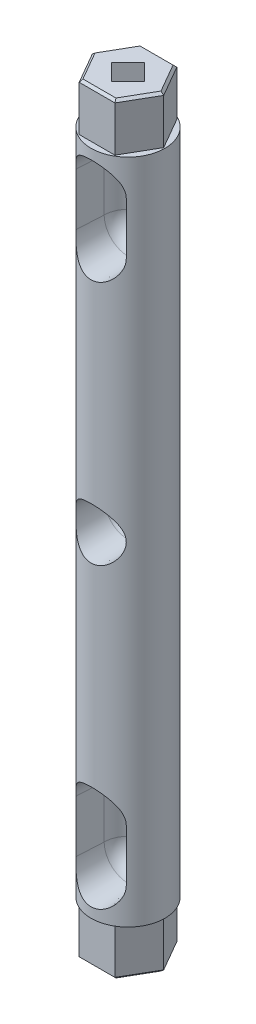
ISO-10303-21;
HEADER;
FILE_DESCRIPTION(('STEP AP214'),'2;1');
FILE_NAME('part.step','',(''),(''),'','','');
FILE_SCHEMA(('AUTOMOTIVE_DESIGN { 1 0 10303 214 1 1 1 1 }'));
ENDSEC;
DATA;
#1=APPLICATION_CONTEXT('core data for automotive mechanical design processes');
#2=APPLICATION_PROTOCOL_DEFINITION('international standard','automotive_design',2000,#1);
#3=PRODUCT_CONTEXT('',#1,'mechanical');
#4=PRODUCT('Part','Part','',(#3));
#5=PRODUCT_RELATED_PRODUCT_CATEGORY('part','',(#4));
#6=PRODUCT_DEFINITION_FORMATION('','',#4);
#7=PRODUCT_DEFINITION_CONTEXT('part definition',#1,'design');
#8=PRODUCT_DEFINITION('design','',#6,#7);
#9=PRODUCT_DEFINITION_SHAPE('','',#8);
#10=(LENGTH_UNIT() NAMED_UNIT(*) SI_UNIT(.MILLI.,.METRE.));
#11=(NAMED_UNIT(*) PLANE_ANGLE_UNIT() SI_UNIT($,.RADIAN.));
#12=(NAMED_UNIT(*) SI_UNIT($,.STERADIAN.) SOLID_ANGLE_UNIT());
#13=UNCERTAINTY_MEASURE_WITH_UNIT(LENGTH_MEASURE(1.E-05),#10,'distance_accuracy_value','');
#14=(GEOMETRIC_REPRESENTATION_CONTEXT(3) GLOBAL_UNCERTAINTY_ASSIGNED_CONTEXT((#13)) GLOBAL_UNIT_ASSIGNED_CONTEXT((#10,
#11,#12)) REPRESENTATION_CONTEXT('',''));
#15=CARTESIAN_POINT('',(0.,0.,0.));
#16=DIRECTION('',(0.,0.,1.));
#17=DIRECTION('',(1.,0.,0.));
#18=AXIS2_PLACEMENT_3D('',#15,#16,#17);
#19=CARTESIAN_POINT('',(0.,0.,0.));
#20=DIRECTION('',(0.,1.,0.));
#21=DIRECTION('',(0.,0.,1.));
#22=AXIS2_PLACEMENT_3D('',#19,#20,#21);
#23=PLANE('',#22);
#24=CARTESIAN_POINT('',(0.,0.,0.));
#25=DIRECTION('',(0.,1.,0.));
#26=DIRECTION('',(0.,0.,1.));
#27=AXIS2_PLACEMENT_3D('',#24,#25,#26);
#28=CIRCLE('',#27,7.75);
#29=CARTESIAN_POINT('',(0.,0.,7.75));
#30=VERTEX_POINT('',#29);
#31=EDGE_CURVE('E437',#30,#30,#28,.T.);
#32=ORIENTED_EDGE('',*,*,#31,.F.);
#33=EDGE_LOOP('',(#32));
#34=FACE_BOUND('',#33,.T.);
#35=DIRECTION('',(0.499999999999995,0.,0.866025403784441));
#36=VECTOR('',#35,1.);
#37=CARTESIAN_POINT('',(3.75000000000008,0.,-6.49519052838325));
#38=LINE('',#37,#36);
#39=CARTESIAN_POINT('',(3.75000000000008,0.,-6.49519052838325));
#40=VERTEX_POINT('',#39);
#41=CARTESIAN_POINT('',(7.5,0.,0.));
#42=VERTEX_POINT('',#41);
#43=EDGE_CURVE('E323',#40,#42,#38,.T.);
#44=ORIENTED_EDGE('',*,*,#43,.F.);
#45=DIRECTION('',(1.,0.,0.));
#46=VECTOR('',#45,1.);
#47=CARTESIAN_POINT('',(-3.74999999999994,0.,-6.49519052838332));
#48=LINE('',#47,#46);
#49=CARTESIAN_POINT('',(-3.74999999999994,0.,-6.49519052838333));
#50=VERTEX_POINT('',#49);
#51=EDGE_CURVE('E344',#50,#40,#48,.T.);
#52=ORIENTED_EDGE('',*,*,#51,.F.);
#53=DIRECTION('',(0.500000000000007,0.,-0.866025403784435));
#54=VECTOR('',#53,1.);
#55=CARTESIAN_POINT('',(-7.5,0.,0.));
#56=LINE('',#55,#54);
#57=CARTESIAN_POINT('',(-7.5,0.,0.));
#58=VERTEX_POINT('',#57);
#59=EDGE_CURVE('E341',#58,#50,#56,.T.);
#60=ORIENTED_EDGE('',*,*,#59,.F.);
#61=DIRECTION('',(-0.499999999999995,0.,-0.866025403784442));
#62=VECTOR('',#61,1.);
#63=CARTESIAN_POINT('',(-3.75000000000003,0.,6.49519052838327));
#64=LINE('',#63,#62);
#65=CARTESIAN_POINT('',(-3.75000000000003,0.,6.49519052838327));
#66=VERTEX_POINT('',#65);
#67=EDGE_CURVE('E338',#66,#58,#64,.T.);
#68=ORIENTED_EDGE('',*,*,#67,.F.);
#69=DIRECTION('',(-1.,0.,0.));
#70=VECTOR('',#69,1.);
#71=CARTESIAN_POINT('',(3.74999999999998,0.,6.4951905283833));
#72=LINE('',#71,#70);
#73=CARTESIAN_POINT('',(3.74999999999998,0.,6.4951905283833));
#74=VERTEX_POINT('',#73);
#75=EDGE_CURVE('E335',#74,#66,#72,.T.);
#76=ORIENTED_EDGE('',*,*,#75,.F.);
#77=DIRECTION('',(-0.500000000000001,0.,0.866025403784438));
#78=VECTOR('',#77,1.);
#79=CARTESIAN_POINT('',(7.5,0.,0.));
#80=LINE('',#79,#78);
#81=EDGE_CURVE('E332',#42,#74,#80,.T.);
#82=ORIENTED_EDGE('',*,*,#81,.F.);
#83=EDGE_LOOP('',(#44,#52,#60,#68,#76,#82));
#84=FACE_BOUND('',#83,.T.);
#85=ADVANCED_FACE('F33',(#34,#84),#23,.F.);
#86=CARTESIAN_POINT('',(0.,140.,0.));
#87=DIRECTION('',(0.,1.,0.));
#88=DIRECTION('',(0.,0.,1.));
#89=AXIS2_PLACEMENT_3D('',#86,#87,#88);
#90=PLANE('',#89);
#91=CARTESIAN_POINT('',(0.,140.,0.));
#92=DIRECTION('',(0.,1.,0.));
#93=DIRECTION('',(0.,0.,1.));
#94=AXIS2_PLACEMENT_3D('',#91,#92,#93);
#95=CIRCLE('',#94,7.75);
#96=CARTESIAN_POINT('',(0.,140.,7.75));
#97=VERTEX_POINT('',#96);
#98=EDGE_CURVE('E446',#97,#97,#95,.T.);
#99=ORIENTED_EDGE('',*,*,#98,.T.);
#100=EDGE_LOOP('',(#99));
#101=FACE_BOUND('',#100,.T.);
#102=DIRECTION('',(-0.500000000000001,0.,-0.866025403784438));
#103=VECTOR('',#102,1.);
#104=CARTESIAN_POINT('',(7.5,140.,0.));
#105=LINE('',#104,#103);
#106=CARTESIAN_POINT('',(7.5,140.,0.));
#107=VERTEX_POINT('',#106);
#108=CARTESIAN_POINT('',(3.74999999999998,140.,-6.4951905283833));
#109=VERTEX_POINT('',#108);
#110=EDGE_CURVE('E362',#107,#109,#105,.T.);
#111=ORIENTED_EDGE('',*,*,#110,.F.);
#112=DIRECTION('',(0.499999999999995,0.,-0.866025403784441));
#113=VECTOR('',#112,1.);
#114=CARTESIAN_POINT('',(3.75000000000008,140.,6.49519052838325));
#115=LINE('',#114,#113);
#116=CARTESIAN_POINT('',(3.75000000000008,140.,6.49519052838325));
#117=VERTEX_POINT('',#116);
#118=EDGE_CURVE('E359',#117,#107,#115,.T.);
#119=ORIENTED_EDGE('',*,*,#118,.F.);
#120=DIRECTION('',(1.,0.,0.));
#121=VECTOR('',#120,1.);
#122=CARTESIAN_POINT('',(-3.74999999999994,140.,6.49519052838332));
#123=LINE('',#122,#121);
#124=CARTESIAN_POINT('',(-3.74999999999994,140.,6.49519052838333));
#125=VERTEX_POINT('',#124);
#126=EDGE_CURVE('E374',#125,#117,#123,.T.);
#127=ORIENTED_EDGE('',*,*,#126,.F.);
#128=DIRECTION('',(0.500000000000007,0.,0.866025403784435));
#129=VECTOR('',#128,1.);
#130=CARTESIAN_POINT('',(-7.5,140.,0.));
#131=LINE('',#130,#129);
#132=CARTESIAN_POINT('',(-7.5,140.,0.));
#133=VERTEX_POINT('',#132);
#134=EDGE_CURVE('E371',#133,#125,#131,.T.);
#135=ORIENTED_EDGE('',*,*,#134,.F.);
#136=DIRECTION('',(-0.499999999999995,0.,0.866025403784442));
#137=VECTOR('',#136,1.);
#138=CARTESIAN_POINT('',(-3.75000000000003,140.,-6.49519052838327));
#139=LINE('',#138,#137);
#140=CARTESIAN_POINT('',(-3.75000000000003,140.,-6.49519052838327));
#141=VERTEX_POINT('',#140);
#142=EDGE_CURVE('E368',#141,#133,#139,.T.);
#143=ORIENTED_EDGE('',*,*,#142,.F.);
#144=DIRECTION('',(-1.,0.,0.));
#145=VECTOR('',#144,1.);
#146=CARTESIAN_POINT('',(3.74999999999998,140.,-6.4951905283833));
#147=LINE('',#146,#145);
#148=EDGE_CURVE('E365',#109,#141,#147,.T.);
#149=ORIENTED_EDGE('',*,*,#148,.F.);
#150=EDGE_LOOP('',(#111,#119,#127,#135,#143,#149));
#151=FACE_BOUND('',#150,.T.);
#152=ADVANCED_FACE('F476',(#101,#151),#90,.T.);
#153=CARTESIAN_POINT('',(0.,140.,0.));
#154=DIRECTION('',(0.,-1.,0.));
#155=DIRECTION('',(0.,0.,-1.));
#156=AXIS2_PLACEMENT_3D('',#153,#154,#155);
#157=CYLINDRICAL_SURFACE('',#156,7.75);
#158=ORIENTED_EDGE('',*,*,#98,.F.);
#159=EDGE_LOOP('',(#158));
#160=FACE_BOUND('',#159,.T.);
#161=ORIENTED_EDGE('',*,*,#31,.T.);
#162=EDGE_LOOP('',(#161));
#163=FACE_BOUND('',#162,.T.);
#164=CARTESIAN_POINT('',(-4.03726198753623,66.4946214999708,6.61536209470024));
#165=CARTESIAN_POINT('',(-3.84736140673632,66.2666579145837,6.7312434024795));
#166=CARTESIAN_POINT('',(-3.63844280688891,66.0543548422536,6.84746060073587));
#167=CARTESIAN_POINT('',(-3.29847803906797,65.7628467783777,7.01417071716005));
#168=CARTESIAN_POINT('',(-3.18062442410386,65.6701075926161,7.06851032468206));
#169=CARTESIAN_POINT('',(-2.9362814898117,65.4942627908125,7.17345098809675));
#170=CARTESIAN_POINT('',(-2.80979134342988,65.4111580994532,7.22405168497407));
#171=CARTESIAN_POINT('',(-2.54757129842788,65.2547740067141,7.32066099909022));
#172=CARTESIAN_POINT('',(-2.41177136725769,65.1815851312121,7.36662643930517));
#173=CARTESIAN_POINT('',(-2.13267599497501,65.0468443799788,7.45221286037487));
#174=CARTESIAN_POINT('',(-1.98938471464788,64.985286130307,7.49183731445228));
#175=CARTESIAN_POINT('',(-1.69638803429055,64.8747910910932,7.56356302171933));
#176=CARTESIAN_POINT('',(-1.54669058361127,64.8258391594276,7.59567329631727));
#177=CARTESIAN_POINT('',(-1.24201549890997,64.7413796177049,7.6513958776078));
#178=CARTESIAN_POINT('',(-1.0870390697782,64.7058689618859,7.67501010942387));
#179=CARTESIAN_POINT('',(-0.796053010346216,64.6531393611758,7.71019316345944));
#180=CARTESIAN_POINT('',(-0.66053550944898,64.6340197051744,7.72300884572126));
#181=CARTESIAN_POINT('',(-0.387939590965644,64.6064847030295,7.7414892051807));
#182=CARTESIAN_POINT('',(-0.250861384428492,64.5980679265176,7.74715483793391));
#183=CARTESIAN_POINT('',(0.0235878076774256,64.5920877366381,7.75117883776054));
#184=CARTESIAN_POINT('',(0.160958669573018,64.594520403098,7.74953984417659));
#185=CARTESIAN_POINT('',(0.434796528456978,64.6101856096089,7.73900675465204));
#186=CARTESIAN_POINT('',(0.571263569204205,64.6234176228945,7.73011301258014));
#187=CARTESIAN_POINT('',(0.827481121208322,64.6584503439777,7.70665245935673));
#188=CARTESIAN_POINT('',(0.947446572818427,64.6791724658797,7.69280129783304));
#189=CARTESIAN_POINT('',(1.18495761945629,64.7287475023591,7.65981582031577));
#190=CARTESIAN_POINT('',(1.3025024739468,64.7576028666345,7.6406799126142));
#191=CARTESIAN_POINT('',(1.65037923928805,64.8558592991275,7.57589735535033));
#192=CARTESIAN_POINT('',(1.87615124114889,64.9369784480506,7.52285686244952));
#193=CARTESIAN_POINT('',(2.32417897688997,65.1328966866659,7.39717781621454));
#194=CARTESIAN_POINT('',(2.54536620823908,65.2494590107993,7.32353529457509));
#195=CARTESIAN_POINT('',(2.96584725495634,65.5099934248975,7.16358057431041));
#196=CARTESIAN_POINT('',(3.16513416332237,65.6539741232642,7.0772643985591));
#197=CARTESIAN_POINT('',(3.5712801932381,65.9920143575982,6.88238876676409));
#198=CARTESIAN_POINT('',(3.77388320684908,66.1904202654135,6.7725178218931));
#199=CARTESIAN_POINT('',(4.14555945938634,66.6168198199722,6.55161171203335));
#200=CARTESIAN_POINT('',(4.31456251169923,66.8448737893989,6.44057460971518));
#201=CARTESIAN_POINT('',(4.55108241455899,67.2233348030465,6.27385038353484));
#202=CARTESIAN_POINT('',(4.63091829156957,67.3647706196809,6.21495874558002));
#203=CARTESIAN_POINT('',(4.77833827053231,67.6559686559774,6.10234172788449));
#204=CARTESIAN_POINT('',(4.84591956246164,67.8057327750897,6.0486175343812));
#205=CARTESIAN_POINT('',(4.96783444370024,68.1124990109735,5.94889188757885));
#206=CARTESIAN_POINT('',(5.02220641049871,68.2694785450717,5.90286818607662));
#207=CARTESIAN_POINT('',(5.11700687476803,68.5901111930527,5.8208835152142));
#208=CARTESIAN_POINT('',(5.15744461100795,68.7537598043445,5.78491588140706));
#209=CARTESIAN_POINT('',(5.21285079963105,69.032869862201,5.73494454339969));
#210=CARTESIAN_POINT('',(5.23182828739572,69.1469534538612,5.7175962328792));
#211=CARTESIAN_POINT('',(5.2626626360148,69.3768486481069,5.68922892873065));
#212=CARTESIAN_POINT('',(5.27452127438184,69.4926598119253,5.67820835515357));
#213=CARTESIAN_POINT('',(5.29092737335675,69.7251415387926,5.66292451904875));
#214=CARTESIAN_POINT('',(5.29548133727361,69.8418112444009,5.65865524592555));
#215=CARTESIAN_POINT('',(5.2972236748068,70.0752595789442,5.65702416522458));
#216=CARTESIAN_POINT('',(5.29441172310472,70.1920382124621,5.65966266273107));
#217=CARTESIAN_POINT('',(5.28147526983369,70.4246837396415,5.67173682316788));
#218=CARTESIAN_POINT('',(5.27136018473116,70.5405516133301,5.6811637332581));
#219=CARTESIAN_POINT('',(5.24399201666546,70.7707493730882,5.70643338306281));
#220=CARTESIAN_POINT('',(5.22673653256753,70.885078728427,5.72227828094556));
#221=CARTESIAN_POINT('',(5.16457675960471,71.2248666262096,5.77865509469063));
#222=CARTESIAN_POINT('',(5.10928479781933,71.4470283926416,5.82802336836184));
#223=CARTESIAN_POINT('',(4.95130119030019,71.9487194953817,5.96330228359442));
#224=CARTESIAN_POINT('',(4.83904336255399,72.2234160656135,6.05587525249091));
#225=CARTESIAN_POINT('',(4.64115913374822,72.6153438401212,6.20718075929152));
#226=CARTESIAN_POINT('',(4.5701760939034,72.7427776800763,6.25976253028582));
#227=CARTESIAN_POINT('',(4.41873252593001,72.990709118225,6.36756980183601));
#228=CARTESIAN_POINT('',(4.33827274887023,73.1112072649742,6.42279509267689));
#229=CARTESIAN_POINT('',(4.08016412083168,73.4659760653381,6.59223033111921));
#230=CARTESIAN_POINT('',(3.88805414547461,73.6890398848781,6.70837932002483));
#231=CARTESIAN_POINT('',(3.46825272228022,74.101730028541,6.93474162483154));
#232=CARTESIAN_POINT('',(3.24059607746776,74.291388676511,7.04496060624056));
#233=CARTESIAN_POINT('',(2.77704715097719,74.614870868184,7.23925315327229));
#234=CARTESIAN_POINT('',(2.54445743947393,74.7524450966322,7.32485276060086));
#235=CARTESIAN_POINT('',(2.17812150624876,74.9320169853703,7.43873159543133));
#236=CARTESIAN_POINT('',(2.05305501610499,74.9874237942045,7.4742808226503));
#237=CARTESIAN_POINT('',(1.79771467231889,75.0886749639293,7.53976502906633));
#238=CARTESIAN_POINT('',(1.66744323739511,75.1345237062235,7.56970258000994));
#239=CARTESIAN_POINT('',(1.40149144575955,75.2163418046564,7.62344195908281));
#240=CARTESIAN_POINT('',(1.26577804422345,75.2522350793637,7.64719645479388));
#241=CARTESIAN_POINT('',(0.990880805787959,75.3131173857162,7.68764918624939));
#242=CARTESIAN_POINT('',(0.851696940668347,75.3381063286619,7.70434736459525));
#243=CARTESIAN_POINT('',(0.571150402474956,75.3767256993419,7.73020820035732));
#244=CARTESIAN_POINT('',(0.429789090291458,75.3903629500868,7.7393753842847));
#245=CARTESIAN_POINT('',(0.146142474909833,75.4060461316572,7.74992101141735));
#246=CARTESIAN_POINT('',(0.00385728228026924,75.4080934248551,7.75130037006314));
#247=CARTESIAN_POINT('',(-0.262908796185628,75.4010242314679,7.74654431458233));
#248=CARTESIAN_POINT('',(-0.387443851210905,75.3932393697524,7.74130525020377));
#249=CARTESIAN_POINT('',(-0.635292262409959,75.3688240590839,7.72491635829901));
#250=CARTESIAN_POINT('',(-0.75860520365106,75.3521907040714,7.71376458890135));
#251=CARTESIAN_POINT('',(-1.00306313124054,75.3103138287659,7.68579789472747));
#252=CARTESIAN_POINT('',(-1.12420884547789,75.2850732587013,7.66898491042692));
#253=CARTESIAN_POINT('',(-1.36362368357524,75.226317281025,7.63005719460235));
#254=CARTESIAN_POINT('',(-1.48189167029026,75.1927986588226,7.60794040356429));
#255=CARTESIAN_POINT('',(-1.83174312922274,75.0802640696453,7.53418348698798));
#256=CARTESIAN_POINT('',(-2.05807488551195,74.9893217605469,7.47517258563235));
#257=CARTESIAN_POINT('',(-2.49222262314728,74.7794220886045,7.34187140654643));
#258=CARTESIAN_POINT('',(-2.70003448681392,74.660458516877,7.26757774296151));
#259=CARTESIAN_POINT('',(-3.12247535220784,74.3796096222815,7.09728379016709));
#260=CARTESIAN_POINT('',(-3.33401962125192,74.2140533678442,6.99970136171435));
#261=CARTESIAN_POINT('',(-3.72847748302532,73.8547715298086,6.7978032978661));
#262=CARTESIAN_POINT('',(-3.9113493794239,73.6610056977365,6.69347816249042));
#263=CARTESIAN_POINT('',(-4.17711826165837,73.3338657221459,6.52897695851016));
#264=CARTESIAN_POINT('',(-4.27005391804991,73.2087145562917,6.46841018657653));
#265=CARTESIAN_POINT('',(-4.44514478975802,72.9501474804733,6.34936307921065));
#266=CARTESIAN_POINT('',(-4.52729765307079,72.8167297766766,6.29088320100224));
#267=CARTESIAN_POINT('',(-4.75670373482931,72.4048630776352,6.12145577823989));
#268=CARTESIAN_POINT('',(-4.88733825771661,72.1142684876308,6.01623852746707));
#269=CARTESIAN_POINT('',(-5.07037311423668,71.5856096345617,5.8621095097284));
#270=CARTESIAN_POINT('',(-5.13430633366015,71.3537587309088,5.80566791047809));
#271=CARTESIAN_POINT('',(-5.2074215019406,70.9980341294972,5.73988632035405));
#272=CARTESIAN_POINT('',(-5.22799257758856,70.8781776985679,5.7211091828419));
#273=CARTESIAN_POINT('',(-5.26126567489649,70.6365191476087,5.6905279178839));
#274=CARTESIAN_POINT('',(-5.27397078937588,70.5147178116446,5.67872104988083));
#275=CARTESIAN_POINT('',(-5.29134247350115,70.2693969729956,5.66253794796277));
#276=CARTESIAN_POINT('',(-5.29596613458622,70.1458717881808,5.6582013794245));
#277=CARTESIAN_POINT('',(-5.29695868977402,69.8987590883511,5.65727225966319));
#278=CARTESIAN_POINT('',(-5.29332757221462,69.7751715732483,5.6606797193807));
#279=CARTESIAN_POINT('',(-5.27787052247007,69.5288687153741,5.67509422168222));
#280=CARTESIAN_POINT('',(-5.26603873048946,69.4061540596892,5.68610669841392));
#281=CARTESIAN_POINT('',(-5.23439435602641,69.1626474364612,5.71524870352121));
#282=CARTESIAN_POINT('',(-5.21458169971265,69.0418554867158,5.73337829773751));
#283=CARTESIAN_POINT('',(-5.14649043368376,68.6980866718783,5.7948051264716));
#284=CARTESIAN_POINT('',(-5.08848592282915,68.478402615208,5.8462301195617));
#285=CARTESIAN_POINT('',(-4.94779455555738,68.0521469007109,5.96575845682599));
#286=CARTESIAN_POINT('',(-4.86510276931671,67.8455778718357,6.03386513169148));
#287=CARTESIAN_POINT('',(-4.67257768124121,67.4375081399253,6.18426411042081));
#288=CARTESIAN_POINT('',(-4.5616295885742,67.2367299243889,6.26708140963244));
#289=CARTESIAN_POINT('',(-4.31659103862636,66.8524489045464,6.43831896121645));
#290=CARTESIAN_POINT('',(-4.18248773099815,66.6689557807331,6.5267423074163));
#291=CARTESIAN_POINT('',(-4.03726198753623,66.4946214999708,6.61536209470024));
#292=B_SPLINE_CURVE_WITH_KNOTS('',3,(#164,#165,#166,#167,#168,#169,#170,#171,#172,#173,#174,
#175,#176,#177,#178,#179,#180,#181,#182,#183,#184,#185,#186,#187,#188,#189,#190,#191,#192,#193,
#194,#195,#196,#197,#198,#199,#200,#201,#202,#203,#204,#205,#206,#207,#208,#209,#210,#211,#212,
#213,#214,#215,#216,#217,#218,#219,#220,#221,#222,#223,#224,#225,#226,#227,#228,#229,#230,#231,
#232,#233,#234,#235,#236,#237,#238,#239,#240,#241,#242,#243,#244,#245,#246,#247,#248,#249,#250,
#251,#252,#253,#254,#255,#256,#257,#258,#259,#260,#261,#262,#263,#264,#265,#266,#267,#268,#269,
#270,#271,#272,#273,#274,#275,#276,#277,#278,#279,#280,#281,#282,#283,#284,#285,#286,#287,#288,
#289,#290,#291),.UNSPECIFIED.,.T.,.F.,(4,2,2,2,2,2,2,2,2,2,2,2,2,2,2,2,2,2,2,2,2,2,2,2,2,2,2,2,
2,2,2,2,2,2,2,2,2,2,2,2,2,2,2,2,2,2,2,2,2,2,2,2,2,2,2,2,2,2,2,2,2,2,2,4),(0.,0.954687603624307,
1.43276724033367,1.91089272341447,2.39312507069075,2.87509236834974,3.35647802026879,
3.83775452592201,4.2495446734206,4.66127978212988,5.07286613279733,5.48443240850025,
5.8515917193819,6.21886173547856,6.95280658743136,7.73184975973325,8.51113792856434,
9.42007413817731,10.3308895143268,10.8485811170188,11.3663912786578,11.8826785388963,
12.3986228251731,12.7490995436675,13.0994887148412,13.4495657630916,13.7996582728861,
14.1493001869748,14.4990597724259,15.1988662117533,16.1262012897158,16.5910119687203,
17.0557858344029,18.0011917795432,18.9456778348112,19.7922141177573,20.215773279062,
20.6391378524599,21.0656538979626,21.4921734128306,21.918436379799,22.3446492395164,
22.7188595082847,23.0931927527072,23.4673978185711,23.84174842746,24.5913565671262,
25.3411309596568,26.1953764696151,27.0508529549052,27.5520386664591,28.0533335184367,
29.0537231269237,29.7917227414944,30.1604656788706,30.5290635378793,30.8996125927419,
31.2701621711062,31.6409767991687,32.0117948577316,32.707835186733,33.4040146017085,
34.1337020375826,34.8637957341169),.UNSPECIFIED.);
#293=CARTESIAN_POINT('',(-4.03726198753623,66.4946214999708,6.61536209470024));
#294=VERTEX_POINT('',#293);
#295=EDGE_CURVE('E449',#294,#294,#292,.T.);
#296=ORIENTED_EDGE('',*,*,#295,.F.);
#297=EDGE_LOOP('',(#296));
#298=FACE_BOUND('',#297,.T.);
#299=CARTESIAN_POINT('',(-5.29650722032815,121.5002,5.65769487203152));
#300=CARTESIAN_POINT('',(-5.29654371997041,121.368469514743,5.65761770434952));
#301=CARTESIAN_POINT('',(-5.29183376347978,121.236779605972,5.66206943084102));
#302=CARTESIAN_POINT('',(-5.27317306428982,120.974786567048,5.67947501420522));
#303=CARTESIAN_POINT('',(-5.2592342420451,120.844481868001,5.69241790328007));
#304=CARTESIAN_POINT('',(-5.22254302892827,120.587454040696,5.72609102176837));
#305=CARTESIAN_POINT('',(-5.19987618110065,120.460708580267,5.74674561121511));
#306=CARTESIAN_POINT('',(-5.14610585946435,120.210339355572,5.79494644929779));
#307=CARTESIAN_POINT('',(-5.11500001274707,120.086716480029,5.8224946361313));
#308=CARTESIAN_POINT('',(-5.04494983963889,119.843877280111,5.88329107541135));
#309=CARTESIAN_POINT('',(-5.00604568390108,119.724641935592,5.91650999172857));
#310=CARTESIAN_POINT('',(-4.92071715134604,119.490384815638,5.98766489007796));
#311=CARTESIAN_POINT('',(-4.8742931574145,119.375362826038,6.02560063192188));
#312=CARTESIAN_POINT('',(-4.72403303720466,119.036484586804,6.1451112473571));
#313=CARTESIAN_POINT('',(-4.60935821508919,118.819326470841,6.23225365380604));
#314=CARTESIAN_POINT('',(-4.33184276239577,118.369666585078,6.42893119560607));
#315=CARTESIAN_POINT('',(-4.16414457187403,118.140729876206,6.539767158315));
#316=CARTESIAN_POINT('',(-3.88714454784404,117.819261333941,6.70553999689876));
#317=CARTESIAN_POINT('',(-3.79050221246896,117.715704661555,6.7607510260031));
#318=CARTESIAN_POINT('',(-3.58885318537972,117.516253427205,6.86991711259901));
#319=CARTESIAN_POINT('',(-3.4838445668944,117.420360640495,6.92387187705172));
#320=CARTESIAN_POINT('',(-3.2508770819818,117.224287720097,7.03656497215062));
#321=CARTESIAN_POINT('',(-3.12174007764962,117.125301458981,7.09495441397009));
#322=CARTESIAN_POINT('',(-2.85352969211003,116.938892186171,7.20700877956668));
#323=CARTESIAN_POINT('',(-2.71446108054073,116.851463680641,7.2606759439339));
#324=CARTESIAN_POINT('',(-2.42718159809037,116.689293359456,7.36168742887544));
#325=CARTESIAN_POINT('',(-2.27898306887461,116.614534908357,7.40904002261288));
#326=CARTESIAN_POINT('',(-1.97426968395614,116.478759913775,7.49598735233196));
#327=CARTESIAN_POINT('',(-1.81775852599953,116.417737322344,7.53558550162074));
#328=CARTESIAN_POINT('',(-1.54137618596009,116.325188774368,7.59610937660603));
#329=CARTESIAN_POINT('',(-1.42313647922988,116.2901558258,7.6191832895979));
#330=CARTESIAN_POINT('',(-1.18362402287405,116.228383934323,7.66004442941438));
#331=CARTESIAN_POINT('',(-1.06235191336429,116.201643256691,7.6778327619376));
#332=CARTESIAN_POINT('',(-0.817603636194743,116.156815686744,7.70773733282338));
#333=CARTESIAN_POINT('',(-0.69412886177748,116.138723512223,7.71985703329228));
#334=CARTESIAN_POINT('',(-0.445756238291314,116.111421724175,7.7381720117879));
#335=CARTESIAN_POINT('',(-0.320858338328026,116.102212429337,7.74436707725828));
#336=CARTESIAN_POINT('',(-0.0703794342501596,116.092806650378,7.7506944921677));
#337=CARTESIAN_POINT('',(0.0552023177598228,116.092623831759,7.75081764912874));
#338=CARTESIAN_POINT('',(0.305954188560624,116.101309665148,7.74497423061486));
#339=CARTESIAN_POINT('',(0.431124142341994,116.110181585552,7.73900545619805));
#340=CARTESIAN_POINT('',(0.680059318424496,116.136848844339,7.72111327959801));
#341=CARTESIAN_POINT('',(0.803824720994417,116.154643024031,7.70919065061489));
#342=CARTESIAN_POINT('',(1.04914597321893,116.198909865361,7.67965269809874));
#343=CARTESIAN_POINT('',(1.17070094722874,116.225385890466,7.66203516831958));
#344=CARTESIAN_POINT('',(1.40858269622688,116.2861066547,7.62185507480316));
#345=CARTESIAN_POINT('',(1.52496444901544,116.320200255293,7.5993889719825));
#346=CARTESIAN_POINT('',(1.75420404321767,116.396023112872,7.54977120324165));
#347=CARTESIAN_POINT('',(1.86706064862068,116.437755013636,7.52261791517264));
#348=CARTESIAN_POINT('',(2.19945871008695,116.57375590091,7.43486934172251));
#349=CARTESIAN_POINT('',(2.41300140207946,116.678874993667,7.36795503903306));
#350=CARTESIAN_POINT('',(2.84435280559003,116.928133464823,7.21322711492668));
#351=CARTESIAN_POINT('',(3.05979578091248,117.075380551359,7.12389110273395));
#352=CARTESIAN_POINT('',(3.46459333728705,117.397467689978,6.93606433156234));
#353=CARTESIAN_POINT('',(3.65392039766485,117.572336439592,6.83756409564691));
#354=CARTESIAN_POINT('',(4.03610680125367,117.979915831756,6.62032244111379));
#355=CARTESIAN_POINT('',(4.22366891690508,118.217386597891,6.50108217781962));
#356=CARTESIAN_POINT('',(4.47432248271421,118.596526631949,6.32876796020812));
#357=CARTESIAN_POINT('',(4.55278852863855,118.726795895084,6.27239584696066));
#358=CARTESIAN_POINT('',(4.69908016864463,118.99470952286,6.16355709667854));
#359=CARTESIAN_POINT('',(4.76690716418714,119.132352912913,6.11108994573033));
#360=CARTESIAN_POINT('',(4.92916135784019,119.500516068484,5.98182524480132));
#361=CARTESIAN_POINT('',(5.01477612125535,119.736739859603,5.90956799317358));
#362=CARTESIAN_POINT('',(5.11895127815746,120.101803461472,5.81901639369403));
#363=CARTESIAN_POINT('',(5.14961360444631,120.225130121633,5.79182614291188));
#364=CARTESIAN_POINT('',(5.20254361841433,120.474859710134,5.74432749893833));
#365=CARTESIAN_POINT('',(5.22481519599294,120.601261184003,5.7240159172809));
#366=CARTESIAN_POINT('',(5.26050568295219,120.855718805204,5.69123903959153));
#367=CARTESIAN_POINT('',(5.27396494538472,120.983764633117,5.67873799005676));
#368=CARTESIAN_POINT('',(5.29199104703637,121.241258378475,5.66192219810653));
#369=CARTESIAN_POINT('',(5.29654063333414,121.370708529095,5.65762333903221));
#370=CARTESIAN_POINT('',(5.29650722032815,121.5002,5.65769487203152));
#371=B_SPLINE_CURVE_WITH_KNOTS('',3,(#299,#300,#301,#302,#303,#304,#305,#306,#307,#308,#309,
#310,#311,#312,#313,#314,#315,#316,#317,#318,#319,#320,#321,#322,#323,#324,#325,#326,#327,#328,
#329,#330,#331,#332,#333,#334,#335,#336,#337,#338,#339,#340,#341,#342,#343,#344,#345,#346,#347,
#348,#349,#350,#351,#352,#353,#354,#355,#356,#357,#358,#359,#360,#361,#362,#363,#364,#365,#366,
#367,#368,#369,#370),.UNSPECIFIED.,.F.,.F.,(4,2,2,2,2,2,2,2,2,2,2,2,2,2,2,2,2,2,2,2,2,2,2,2,2,2,
2,2,2,2,2,2,2,2,2,4),(0.,0.394966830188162,0.78942449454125,1.18011064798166,1.57090677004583,
1.95973929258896,2.34855202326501,3.12780825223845,4.03816496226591,4.49390079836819,
4.94974189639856,5.46764674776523,5.98530452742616,6.50227728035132,7.01902196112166,
7.39501812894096,7.77093558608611,8.14662315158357,8.5223241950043,8.89859400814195,
9.274999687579,9.65135649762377,10.0278592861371,10.3974675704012,10.7672040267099,
11.5061388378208,12.330580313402,13.1558840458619,14.1271496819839,14.6132417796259,
15.0992697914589,15.8800373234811,16.2695188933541,16.658819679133,17.0463250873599,
17.4345801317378),.UNSPECIFIED.);
#372=CARTESIAN_POINT('',(-5.29650722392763,121.5,5.65769486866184));
#373=VERTEX_POINT('',#372);
#374=CARTESIAN_POINT('',(5.29650722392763,121.5,5.65769486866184));
#375=VERTEX_POINT('',#374);
#376=EDGE_CURVE('E458',#373,#375,#371,.T.);
#377=ORIENTED_EDGE('',*,*,#376,.F.);
#378=DIRECTION('',(0.,-1.,0.));
#379=VECTOR('',#378,1.);
#380=CARTESIAN_POINT('',(-5.29650722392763,140.,5.65769486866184));
#381=LINE('',#380,#379);
#382=CARTESIAN_POINT('',(-5.29650722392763,132.5,5.65769486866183));
#383=VERTEX_POINT('',#382);
#384=EDGE_CURVE('E1109',#383,#373,#381,.T.);
#385=ORIENTED_EDGE('',*,*,#384,.F.);
#386=CARTESIAN_POINT('',(5.29650722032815,132.4998,5.65769487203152));
#387=CARTESIAN_POINT('',(5.29654371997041,132.631530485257,5.65761770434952));
#388=CARTESIAN_POINT('',(5.29183376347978,132.763220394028,5.66206943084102));
#389=CARTESIAN_POINT('',(5.27317306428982,133.025213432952,5.67947501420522));
#390=CARTESIAN_POINT('',(5.2592342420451,133.155518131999,5.69241790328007));
#391=CARTESIAN_POINT('',(5.22254302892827,133.412545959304,5.72609102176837));
#392=CARTESIAN_POINT('',(5.19987618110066,133.539291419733,5.7467456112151));
#393=CARTESIAN_POINT('',(5.14610585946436,133.789660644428,5.79494644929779));
#394=CARTESIAN_POINT('',(5.11500001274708,133.913283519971,5.82249463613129));
#395=CARTESIAN_POINT('',(5.0449498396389,134.156122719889,5.88329107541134));
#396=CARTESIAN_POINT('',(5.00604568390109,134.275358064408,5.91650999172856));
#397=CARTESIAN_POINT('',(4.92071715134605,134.509615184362,5.98766489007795));
#398=CARTESIAN_POINT('',(4.87429315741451,134.624637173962,6.02560063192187));
#399=CARTESIAN_POINT('',(4.72403303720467,134.963515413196,6.14511124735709));
#400=CARTESIAN_POINT('',(4.6093582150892,135.180673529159,6.23225365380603));
#401=CARTESIAN_POINT('',(4.33184276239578,135.630333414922,6.42893119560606));
#402=CARTESIAN_POINT('',(4.16414457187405,135.859270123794,6.539767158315));
#403=CARTESIAN_POINT('',(3.88714454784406,136.180738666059,6.70553999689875));
#404=CARTESIAN_POINT('',(3.79050221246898,136.284295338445,6.76075102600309));
#405=CARTESIAN_POINT('',(3.58885318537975,136.483746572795,6.869917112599));
#406=CARTESIAN_POINT('',(3.48384456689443,136.579639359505,6.92387187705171));
#407=CARTESIAN_POINT('',(3.25087708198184,136.775712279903,7.0365649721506));
#408=CARTESIAN_POINT('',(3.12174007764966,136.874698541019,7.09495441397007));
#409=CARTESIAN_POINT('',(2.85352969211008,137.061107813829,7.20700877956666));
#410=CARTESIAN_POINT('',(2.71446108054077,137.148536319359,7.26067594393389));
#411=CARTESIAN_POINT('',(2.42718159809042,137.310706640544,7.36168742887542));
#412=CARTESIAN_POINT('',(2.27898306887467,137.385465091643,7.40904002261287));
#413=CARTESIAN_POINT('',(1.9742696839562,137.521240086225,7.49598735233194));
#414=CARTESIAN_POINT('',(1.81775852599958,137.582262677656,7.53558550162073));
#415=CARTESIAN_POINT('',(1.54137618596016,137.674811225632,7.59610937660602));
#416=CARTESIAN_POINT('',(1.42313647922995,137.7098441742,7.61918328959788));
#417=CARTESIAN_POINT('',(1.18362402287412,137.771616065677,7.66004442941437));
#418=CARTESIAN_POINT('',(1.06235191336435,137.798356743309,7.67783276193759));
#419=CARTESIAN_POINT('',(0.817603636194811,137.843184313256,7.70773733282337));
#420=CARTESIAN_POINT('',(0.694128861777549,137.861276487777,7.71985703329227));
#421=CARTESIAN_POINT('',(0.445756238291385,137.888578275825,7.73817201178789));
#422=CARTESIAN_POINT('',(0.320858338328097,137.897787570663,7.74436707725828));
#423=CARTESIAN_POINT('',(0.0703794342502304,137.907193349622,7.75069449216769));
#424=CARTESIAN_POINT('',(-0.0552023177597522,137.907376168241,7.75081764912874));
#425=CARTESIAN_POINT('',(-0.305954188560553,137.898690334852,7.74497423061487));
#426=CARTESIAN_POINT('',(-0.431124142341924,137.889818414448,7.73900545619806));
#427=CARTESIAN_POINT('',(-0.680059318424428,137.863151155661,7.72111327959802));
#428=CARTESIAN_POINT('',(-0.803824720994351,137.845356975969,7.70919065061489));
#429=CARTESIAN_POINT('',(-1.04914597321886,137.80109013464,7.67965269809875));
#430=CARTESIAN_POINT('',(-1.17070094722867,137.774614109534,7.66203516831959));
#431=CARTESIAN_POINT('',(-1.40858269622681,137.7138933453,7.62185507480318));
#432=CARTESIAN_POINT('',(-1.52496444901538,137.679799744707,7.59938897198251));
#433=CARTESIAN_POINT('',(-1.75420404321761,137.603976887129,7.54977120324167));
#434=CARTESIAN_POINT('',(-1.86706064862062,137.562244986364,7.52261791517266));
#435=CARTESIAN_POINT('',(-2.19945871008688,137.42624409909,7.43486934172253));
#436=CARTESIAN_POINT('',(-2.4130014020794,137.321125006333,7.36795503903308));
#437=CARTESIAN_POINT('',(-2.84435280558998,137.071866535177,7.21322711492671));
#438=CARTESIAN_POINT('',(-3.05979578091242,136.924619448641,7.12389110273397));
#439=CARTESIAN_POINT('',(-3.464593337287,136.602532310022,6.93606433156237));
#440=CARTESIAN_POINT('',(-3.6539203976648,136.427663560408,6.83756409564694));
#441=CARTESIAN_POINT('',(-4.03610680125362,136.020084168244,6.62032244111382));
#442=CARTESIAN_POINT('',(-4.22366891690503,135.782613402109,6.50108217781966));
#443=CARTESIAN_POINT('',(-4.47432248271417,135.403473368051,6.32876796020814));
#444=CARTESIAN_POINT('',(-4.55278852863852,135.273204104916,6.27239584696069));
#445=CARTESIAN_POINT('',(-4.6990801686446,135.00529047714,6.16355709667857));
#446=CARTESIAN_POINT('',(-4.7669071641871,134.867647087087,6.11108994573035));
#447=CARTESIAN_POINT('',(-4.92916135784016,134.499483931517,5.98182524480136));
#448=CARTESIAN_POINT('',(-5.01477612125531,134.263260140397,5.90956799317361));
#449=CARTESIAN_POINT('',(-5.11895127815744,133.898196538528,5.81901639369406));
#450=CARTESIAN_POINT('',(-5.14961360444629,133.774869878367,5.7918261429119));
#451=CARTESIAN_POINT('',(-5.20254361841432,133.525140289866,5.74432749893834));
#452=CARTESIAN_POINT('',(-5.22481519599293,133.398738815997,5.72401591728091));
#453=CARTESIAN_POINT('',(-5.26050568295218,133.144281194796,5.69123903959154));
#454=CARTESIAN_POINT('',(-5.27396494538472,133.016235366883,5.67873799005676));
#455=CARTESIAN_POINT('',(-5.29199104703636,132.758741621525,5.66192219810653));
#456=CARTESIAN_POINT('',(-5.29654063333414,132.629291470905,5.65762333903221));
#457=CARTESIAN_POINT('',(-5.29650722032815,132.4998,5.65769487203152));
#458=B_SPLINE_CURVE_WITH_KNOTS('',3,(#386,#387,#388,#389,#390,#391,#392,#393,#394,#395,#396,
#397,#398,#399,#400,#401,#402,#403,#404,#405,#406,#407,#408,#409,#410,#411,#412,#413,#414,#415,
#416,#417,#418,#419,#420,#421,#422,#423,#424,#425,#426,#427,#428,#429,#430,#431,#432,#433,#434,
#435,#436,#437,#438,#439,#440,#441,#442,#443,#444,#445,#446,#447,#448,#449,#450,#451,#452,#453,
#454,#455,#456,#457),.UNSPECIFIED.,.F.,.F.,(4,2,2,2,2,2,2,2,2,2,2,2,2,2,2,2,2,2,2,2,2,2,2,2,2,2,
2,2,2,2,2,2,2,2,2,4),(0.,0.394966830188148,0.789424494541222,1.18011064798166,1.5709067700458,
1.95973929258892,2.34855202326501,3.12780825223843,4.03816496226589,4.49390079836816,
4.94974189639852,5.46764674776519,5.9853045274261,6.50227728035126,7.01902196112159,
7.39501812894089,7.77093558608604,8.1466231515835,8.52232419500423,8.89859400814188,
9.27499968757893,9.65135649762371,10.027859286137,10.3974675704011,10.7672040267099,
11.5061388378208,12.3305803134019,13.1558840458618,14.1271496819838,14.6132417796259,
15.0992697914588,15.880037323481,16.269518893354,16.658819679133,17.0463250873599,
17.4345801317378),.UNSPECIFIED.);
#459=CARTESIAN_POINT('',(5.29650722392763,132.5,5.65769486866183));
#460=VERTEX_POINT('',#459);
#461=EDGE_CURVE('E1132',#460,#383,#458,.T.);
#462=ORIENTED_EDGE('',*,*,#461,.F.);
#463=DIRECTION('',(0.,-1.,0.));
#464=VECTOR('',#463,1.);
#465=CARTESIAN_POINT('',(5.29650722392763,140.,5.65769486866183));
#466=LINE('',#465,#464);
#467=EDGE_CURVE('E1137',#375,#460,#466,.F.);
#468=ORIENTED_EDGE('',*,*,#467,.F.);
#469=EDGE_LOOP('',(#377,#385,#462,#468));
#470=FACE_BOUND('',#469,.T.);
#471=CARTESIAN_POINT('',(-5.29650722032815,7.50020000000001,5.65769487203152));
#472=CARTESIAN_POINT('',(-5.29654371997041,7.36846951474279,5.65761770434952));
#473=CARTESIAN_POINT('',(-5.29183376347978,7.23677960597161,5.66206943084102));
#474=CARTESIAN_POINT('',(-5.27317306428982,6.97478656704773,5.67947501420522));
#475=CARTESIAN_POINT('',(-5.2592342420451,6.84448186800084,5.69241790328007));
#476=CARTESIAN_POINT('',(-5.22254302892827,6.58745404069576,5.72609102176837));
#477=CARTESIAN_POINT('',(-5.19987618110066,6.4607085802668,5.7467456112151));
#478=CARTESIAN_POINT('',(-5.14610585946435,6.210339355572,5.79494644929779));
#479=CARTESIAN_POINT('',(-5.11500001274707,6.08671648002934,5.8224946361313));
#480=CARTESIAN_POINT('',(-5.04494983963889,5.84387728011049,5.88329107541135));
#481=CARTESIAN_POINT('',(-5.00604568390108,5.7246419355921,5.91650999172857));
#482=CARTESIAN_POINT('',(-4.92071715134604,5.49038481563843,5.98766489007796));
#483=CARTESIAN_POINT('',(-4.8742931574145,5.37536282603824,6.02560063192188));
#484=CARTESIAN_POINT('',(-4.72403303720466,5.03648458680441,6.1451112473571));
#485=CARTESIAN_POINT('',(-4.60935821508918,4.81932647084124,6.23225365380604));
#486=CARTESIAN_POINT('',(-4.33184276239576,4.36966658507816,6.42893119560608));
#487=CARTESIAN_POINT('',(-4.16414457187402,4.14072987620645,6.53976715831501));
#488=CARTESIAN_POINT('',(-3.88714454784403,3.81926133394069,6.70553999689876));
#489=CARTESIAN_POINT('',(-3.79050221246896,3.71570466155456,6.7607510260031));
#490=CARTESIAN_POINT('',(-3.58885318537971,3.51625342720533,6.86991711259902));
#491=CARTESIAN_POINT('',(-3.48384456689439,3.42036064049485,6.92387187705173));
#492=CARTESIAN_POINT('',(-3.25087708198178,3.2242877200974,7.03656497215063));
#493=CARTESIAN_POINT('',(-3.1217400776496,3.12530145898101,7.0949544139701));
#494=CARTESIAN_POINT('',(-2.85352969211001,2.93889218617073,7.20700877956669));
#495=CARTESIAN_POINT('',(-2.7144610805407,2.8514636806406,7.26067594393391));
#496=CARTESIAN_POINT('',(-2.42718159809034,2.68929335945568,7.36168742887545));
#497=CARTESIAN_POINT('',(-2.27898306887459,2.61453490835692,7.40904002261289));
#498=CARTESIAN_POINT('',(-1.97426968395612,2.47875991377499,7.49598735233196));
#499=CARTESIAN_POINT('',(-1.8177585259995,2.41773732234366,7.53558550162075));
#500=CARTESIAN_POINT('',(-1.54137618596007,2.32518877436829,7.59610937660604));
#501=CARTESIAN_POINT('',(-1.42313647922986,2.29015582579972,7.6191832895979));
#502=CARTESIAN_POINT('',(-1.18362402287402,2.2283839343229,7.66004442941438));
#503=CARTESIAN_POINT('',(-1.06235191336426,2.20164325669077,7.67783276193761));
#504=CARTESIAN_POINT('',(-0.81760363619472,2.15681568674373,7.70773733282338));
#505=CARTESIAN_POINT('',(-0.694128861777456,2.13872351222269,7.71985703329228));
#506=CARTESIAN_POINT('',(-0.44575623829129,2.11142172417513,7.7381720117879));
#507=CARTESIAN_POINT('',(-0.320858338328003,2.10221242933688,7.74436707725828));
#508=CARTESIAN_POINT('',(-0.0703794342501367,2.09280665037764,7.7506944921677));
#509=CARTESIAN_POINT('',(0.0552023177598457,2.09262383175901,7.75081764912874));
#510=CARTESIAN_POINT('',(0.305954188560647,2.10130966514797,7.74497423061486));
#511=CARTESIAN_POINT('',(0.431124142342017,2.11018158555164,7.73900545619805));
#512=CARTESIAN_POINT('',(0.680059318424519,2.13684884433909,7.72111327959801));
#513=CARTESIAN_POINT('',(0.803824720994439,2.15464302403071,7.70919065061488));
#514=CARTESIAN_POINT('',(1.04914597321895,2.1989098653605,7.67965269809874));
#515=CARTESIAN_POINT('',(1.17070094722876,2.22538589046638,7.66203516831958));
#516=CARTESIAN_POINT('',(1.4085826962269,2.28610665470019,7.62185507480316));
#517=CARTESIAN_POINT('',(1.52496444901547,2.32020025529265,7.59938897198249));
#518=CARTESIAN_POINT('',(1.75420404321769,2.3960231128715,7.54977120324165));
#519=CARTESIAN_POINT('',(1.8670606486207,2.43775501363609,7.52261791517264));
#520=CARTESIAN_POINT('',(2.19945871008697,2.57375590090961,7.43486934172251));
#521=CARTESIAN_POINT('',(2.41300140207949,2.67887499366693,7.36795503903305));
#522=CARTESIAN_POINT('',(2.84435280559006,2.92813346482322,7.21322711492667));
#523=CARTESIAN_POINT('',(3.05979578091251,3.07538055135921,7.12389110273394));
#524=CARTESIAN_POINT('',(3.46459333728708,3.39746768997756,6.93606433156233));
#525=CARTESIAN_POINT('',(3.65392039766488,3.57233643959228,6.8375640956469));
#526=CARTESIAN_POINT('',(4.0361068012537,3.97991583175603,6.62032244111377));
#527=CARTESIAN_POINT('',(4.2236689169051,4.21738659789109,6.50108217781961));
#528=CARTESIAN_POINT('',(4.47432248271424,4.59652663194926,6.3287679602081));
#529=CARTESIAN_POINT('',(4.55278852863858,4.7267958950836,6.27239584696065));
#530=CARTESIAN_POINT('',(4.69908016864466,4.99470952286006,6.16355709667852));
#531=CARTESIAN_POINT('',(4.76690716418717,5.13235291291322,6.1110899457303));
#532=CARTESIAN_POINT('',(4.92916135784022,5.50051606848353,5.9818252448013));
#533=CARTESIAN_POINT('',(5.01477612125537,5.73673985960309,5.90956799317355));
#534=CARTESIAN_POINT('',(5.11895127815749,6.10180346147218,5.81901639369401));
#535=CARTESIAN_POINT('',(5.14961360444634,6.22513012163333,5.79182614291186));
#536=CARTESIAN_POINT('',(5.20254361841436,6.47485971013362,5.7443274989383));
#537=CARTESIAN_POINT('',(5.22481519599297,6.601261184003,5.72401591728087));
#538=CARTESIAN_POINT('',(5.26050568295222,6.85571880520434,5.69123903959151));
#539=CARTESIAN_POINT('',(5.27396494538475,6.98376463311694,5.67873799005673));
#540=CARTESIAN_POINT('',(5.29199104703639,7.24125837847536,5.66192219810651));
#541=CARTESIAN_POINT('',(5.29654063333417,7.37070852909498,5.65762333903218));
#542=CARTESIAN_POINT('',(5.29650722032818,7.50020000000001,5.65769487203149));
#543=B_SPLINE_CURVE_WITH_KNOTS('',3,(#471,#472,#473,#474,#475,#476,#477,#478,#479,#480,#481,
#482,#483,#484,#485,#486,#487,#488,#489,#490,#491,#492,#493,#494,#495,#496,#497,#498,#499,#500,
#501,#502,#503,#504,#505,#506,#507,#508,#509,#510,#511,#512,#513,#514,#515,#516,#517,#518,#519,
#520,#521,#522,#523,#524,#525,#526,#527,#528,#529,#530,#531,#532,#533,#534,#535,#536,#537,#538,
#539,#540,#541,#542),.UNSPECIFIED.,.F.,.F.,(4,2,2,2,2,2,2,2,2,2,2,2,2,2,2,2,2,2,2,2,2,2,2,2,2,2,
2,2,2,2,2,2,2,2,2,4),(0.,0.394966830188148,0.789424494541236,1.18011064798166,1.57090677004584,
1.95973929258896,2.34855202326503,3.12780825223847,4.03816496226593,4.4939007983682,
4.94974189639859,5.46764674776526,5.98530452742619,6.50227728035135,7.01902196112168,
7.395018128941,7.77093558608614,8.1466231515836,8.52232419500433,8.89859400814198,
9.27499968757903,9.6513564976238,10.0278592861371,10.3974675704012,10.7672040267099,
11.5061388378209,12.330580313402,13.1558840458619,14.1271496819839,14.613241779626,
15.0992697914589,15.8800373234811,16.2695188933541,16.6588196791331,17.04632508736,
17.4345801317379),.UNSPECIFIED.);
#544=CARTESIAN_POINT('',(-5.29650722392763,7.50000000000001,5.65769486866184));
#545=VERTEX_POINT('',#544);
#546=CARTESIAN_POINT('',(5.29650722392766,7.50000000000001,5.65769486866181));
#547=VERTEX_POINT('',#546);
#548=EDGE_CURVE('E1102',#545,#547,#543,.T.);
#549=ORIENTED_EDGE('',*,*,#548,.F.);
#550=DIRECTION('',(0.,-1.,0.));
#551=VECTOR('',#550,1.);
#552=CARTESIAN_POINT('',(-5.2965072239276,140.,5.65769486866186));
#553=LINE('',#552,#551);
#554=CARTESIAN_POINT('',(-5.29650722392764,18.5,5.65769486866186));
#555=VERTEX_POINT('',#554);
#556=EDGE_CURVE('E1104',#555,#545,#553,.T.);
#557=ORIENTED_EDGE('',*,*,#556,.F.);
#558=CARTESIAN_POINT('',(5.29650722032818,18.4998,5.6576948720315));
#559=CARTESIAN_POINT('',(5.29654371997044,18.6315304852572,5.6576177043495));
#560=CARTESIAN_POINT('',(5.2918337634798,18.7632203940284,5.66206943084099));
#561=CARTESIAN_POINT('',(5.27317306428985,19.0252134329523,5.6794750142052));
#562=CARTESIAN_POINT('',(5.25923424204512,19.1555181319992,5.69241790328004));
#563=CARTESIAN_POINT('',(5.22254302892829,19.4125459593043,5.72609102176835));
#564=CARTESIAN_POINT('',(5.19987618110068,19.5392914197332,5.74674561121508));
#565=CARTESIAN_POINT('',(5.14610585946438,19.789660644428,5.79494644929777));
#566=CARTESIAN_POINT('',(5.1150000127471,19.9132835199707,5.82249463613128));
#567=CARTESIAN_POINT('',(5.04494983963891,20.1561227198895,5.88329107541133));
#568=CARTESIAN_POINT('',(5.0060456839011,20.2753580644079,5.91650999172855));
#569=CARTESIAN_POINT('',(4.92071715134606,20.5096151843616,5.98766489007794));
#570=CARTESIAN_POINT('',(4.87429315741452,20.6246371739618,6.02560063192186));
#571=CARTESIAN_POINT('',(4.72403303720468,20.9635154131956,6.14511124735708));
#572=CARTESIAN_POINT('',(4.60935821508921,21.1806735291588,6.23225365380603));
#573=CARTESIAN_POINT('',(4.33184276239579,21.6303334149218,6.42893119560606));
#574=CARTESIAN_POINT('',(4.16414457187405,21.8592701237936,6.539767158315));
#575=CARTESIAN_POINT('',(3.88714454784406,22.1807386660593,6.70553999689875));
#576=CARTESIAN_POINT('',(3.79050221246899,22.2842953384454,6.76075102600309));
#577=CARTESIAN_POINT('',(3.58885318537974,22.4837465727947,6.869917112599));
#578=CARTESIAN_POINT('',(3.48384456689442,22.5796393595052,6.92387187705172));
#579=CARTESIAN_POINT('',(3.25087708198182,22.7757122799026,7.03656497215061));
#580=CARTESIAN_POINT('',(3.12174007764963,22.874698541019,7.09495441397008));
#581=CARTESIAN_POINT('',(2.85352969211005,23.0611078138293,7.20700877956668));
#582=CARTESIAN_POINT('',(2.71446108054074,23.1485363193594,7.2606759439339));
#583=CARTESIAN_POINT('',(2.42718159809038,23.3107066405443,7.36168742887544));
#584=CARTESIAN_POINT('',(2.27898306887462,23.3854650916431,7.40904002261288));
#585=CARTESIAN_POINT('',(1.97426968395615,23.521240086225,7.49598735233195));
#586=CARTESIAN_POINT('',(1.81775852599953,23.5822626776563,7.53558550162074));
#587=CARTESIAN_POINT('',(1.5413761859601,23.6748112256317,7.59610937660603));
#588=CARTESIAN_POINT('',(1.42313647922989,23.7098441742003,7.61918328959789));
#589=CARTESIAN_POINT('',(1.18362402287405,23.7716160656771,7.66004442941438));
#590=CARTESIAN_POINT('',(1.06235191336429,23.7983567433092,7.6778327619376));
#591=CARTESIAN_POINT('',(0.817603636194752,23.8431843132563,7.70773733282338));
#592=CARTESIAN_POINT('',(0.694128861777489,23.8612764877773,7.71985703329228));
#593=CARTESIAN_POINT('',(0.445756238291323,23.8885782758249,7.7381720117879));
#594=CARTESIAN_POINT('',(0.320858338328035,23.8977875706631,7.74436707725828));
#595=CARTESIAN_POINT('',(0.0703794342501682,23.9071933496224,7.7506944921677));
#596=CARTESIAN_POINT('',(-0.0552023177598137,23.907376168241,7.75081764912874));
#597=CARTESIAN_POINT('',(-0.305954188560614,23.898690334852,7.74497423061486));
#598=CARTESIAN_POINT('',(-0.431124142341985,23.8898184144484,7.73900545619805));
#599=CARTESIAN_POINT('',(-0.680059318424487,23.8631511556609,7.72111327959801));
#600=CARTESIAN_POINT('',(-0.803824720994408,23.8453569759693,7.70919065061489));
#601=CARTESIAN_POINT('',(-1.04914597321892,23.8010901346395,7.67965269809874));
#602=CARTESIAN_POINT('',(-1.17070094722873,23.7746141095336,7.66203516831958));
#603=CARTESIAN_POINT('',(-1.40858269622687,23.7138933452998,7.62185507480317));
#604=CARTESIAN_POINT('',(-1.52496444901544,23.6797997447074,7.5993889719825));
#605=CARTESIAN_POINT('',(-1.75420404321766,23.6039768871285,7.54977120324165));
#606=CARTESIAN_POINT('',(-1.86706064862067,23.5622449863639,7.52261791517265));
#607=CARTESIAN_POINT('',(-2.19945871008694,23.4262440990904,7.43486934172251));
#608=CARTESIAN_POINT('',(-2.41300140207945,23.3211250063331,7.36795503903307));
#609=CARTESIAN_POINT('',(-2.84435280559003,23.0718665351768,7.21322711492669));
#610=CARTESIAN_POINT('',(-3.05979578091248,22.9246194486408,7.12389110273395));
#611=CARTESIAN_POINT('',(-3.46459333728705,22.6025323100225,6.93606433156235));
#612=CARTESIAN_POINT('',(-3.65392039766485,22.4276635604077,6.83756409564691));
#613=CARTESIAN_POINT('',(-4.03610680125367,22.020084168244,6.62032244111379));
#614=CARTESIAN_POINT('',(-4.22366891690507,21.7826134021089,6.50108217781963));
#615=CARTESIAN_POINT('',(-4.47432248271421,21.4034733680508,6.32876796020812));
#616=CARTESIAN_POINT('',(-4.55278852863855,21.2732041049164,6.27239584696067));
#617=CARTESIAN_POINT('',(-4.69908016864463,21.0052904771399,6.16355709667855));
#618=CARTESIAN_POINT('',(-4.76690716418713,20.8676470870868,6.11108994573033));
#619=CARTESIAN_POINT('',(-4.92916135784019,20.4994839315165,5.98182524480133));
#620=CARTESIAN_POINT('',(-5.01477612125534,20.2632601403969,5.90956799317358));
#621=CARTESIAN_POINT('',(-5.11895127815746,19.8981965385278,5.81901639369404));
#622=CARTESIAN_POINT('',(-5.14961360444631,19.7748698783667,5.79182614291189));
#623=CARTESIAN_POINT('',(-5.20254361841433,19.5251402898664,5.74432749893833));
#624=CARTESIAN_POINT('',(-5.22481519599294,19.398738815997,5.7240159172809));
#625=CARTESIAN_POINT('',(-5.26050568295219,19.1442811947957,5.69123903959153));
#626=CARTESIAN_POINT('',(-5.27396494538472,19.0162353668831,5.67873799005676));
#627=CARTESIAN_POINT('',(-5.29199104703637,18.7587416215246,5.66192219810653));
#628=CARTESIAN_POINT('',(-5.29654063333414,18.629291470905,5.65762333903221));
#629=CARTESIAN_POINT('',(-5.29650722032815,18.4998,5.65769487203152));
#630=B_SPLINE_CURVE_WITH_KNOTS('',3,(#558,#559,#560,#561,#562,#563,#564,#565,#566,#567,#568,
#569,#570,#571,#572,#573,#574,#575,#576,#577,#578,#579,#580,#581,#582,#583,#584,#585,#586,#587,
#588,#589,#590,#591,#592,#593,#594,#595,#596,#597,#598,#599,#600,#601,#602,#603,#604,#605,#606,
#607,#608,#609,#610,#611,#612,#613,#614,#615,#616,#617,#618,#619,#620,#621,#622,#623,#624,#625,
#626,#627,#628,#629),.UNSPECIFIED.,.F.,.F.,(4,2,2,2,2,2,2,2,2,2,2,2,2,2,2,2,2,2,2,2,2,2,2,2,2,2,
2,2,2,2,2,2,2,2,2,4),(0.,0.394966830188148,0.78942449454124,1.18011064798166,1.57090677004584,
1.95973929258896,2.34855202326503,3.12780825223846,4.03816496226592,4.4939007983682,
4.94974189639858,5.46764674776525,5.98530452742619,6.50227728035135,7.01902196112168,
7.39501812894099,7.77093558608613,8.1466231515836,8.52232419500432,8.89859400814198,
9.27499968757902,9.6513564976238,10.0278592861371,10.3974675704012,10.7672040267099,
11.5061388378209,12.330580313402,13.1558840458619,14.1271496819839,14.613241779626,
15.0992697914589,15.8800373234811,16.2695188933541,16.6588196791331,17.04632508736,
17.4345801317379),.UNSPECIFIED.);
#631=CARTESIAN_POINT('',(5.29650722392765,18.5,5.65769486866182));
#632=VERTEX_POINT('',#631);
#633=EDGE_CURVE('E1108',#632,#555,#630,.T.);
#634=ORIENTED_EDGE('',*,*,#633,.F.);
#635=DIRECTION('',(0.,-1.,0.));
#636=VECTOR('',#635,1.);
#637=CARTESIAN_POINT('',(5.29650722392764,140.,5.65769486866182));
#638=LINE('',#637,#636);
#639=EDGE_CURVE('E1106',#547,#632,#638,.F.);
#640=ORIENTED_EDGE('',*,*,#639,.F.);
#641=EDGE_LOOP('',(#549,#557,#634,#640));
#642=FACE_BOUND('',#641,.T.);
#643=ADVANCED_FACE('F464',(#160,#163,#298,#470,#642),#157,.T.);
#644=CARTESIAN_POINT('',(0.,70.,0.));
#645=DIRECTION('',(0.,0.,1.));
#646=DIRECTION('',(1.,0.,0.));
#647=AXIS2_PLACEMENT_3D('',#644,#645,#646);
#648=CONICAL_SURFACE('',#647,5.00000000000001,0.0523598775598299);
#649=CARTESIAN_POINT('',(0.,70.,0.));
#650=DIRECTION('',(0.,0.,1.));
#651=DIRECTION('',(1.,0.,0.));
#652=AXIS2_PLACEMENT_3D('',#649,#650,#651);
#653=CIRCLE('',#652,5.);
#654=CARTESIAN_POINT('',(5.,70.,0.));
#655=VERTEX_POINT('',#654);
#656=EDGE_CURVE('E395',#655,#655,#653,.F.);
#657=ORIENTED_EDGE('',*,*,#656,.T.);
#658=EDGE_LOOP('',(#657));
#659=FACE_BOUND('',#658,.T.);
#660=ORIENTED_EDGE('',*,*,#295,.T.);
#661=EDGE_LOOP('',(#660));
#662=FACE_BOUND('',#661,.T.);
#663=ADVANCED_FACE('F468',(#659,#662),#648,.F.);
#664=CARTESIAN_POINT('',(0.,132.5,0.));
#665=DIRECTION('',(0.,0.,1.));
#666=DIRECTION('',(1.,0.,0.));
#667=AXIS2_PLACEMENT_3D('',#664,#665,#666);
#668=CONICAL_SURFACE('',#667,5.,0.0523598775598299);
#669=DIRECTION('',(0.0523359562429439,0.,0.998629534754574));
#670=VECTOR('',#669,1.);
#671=CARTESIAN_POINT('',(5.,132.5,0.));
#672=LINE('',#671,#670);
#673=CARTESIAN_POINT('',(5.,132.5,0.));
#674=VERTEX_POINT('',#673);
#675=EDGE_CURVE('E433',#460,#674,#672,.F.);
#676=ORIENTED_EDGE('',*,*,#675,.F.);
#677=ORIENTED_EDGE('',*,*,#461,.T.);
#678=DIRECTION('',(-0.0523359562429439,0.,0.998629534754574));
#679=VECTOR('',#678,1.);
#680=CARTESIAN_POINT('',(-5.,132.5,0.));
#681=LINE('',#680,#679);
#682=CARTESIAN_POINT('',(-5.,132.5,0.));
#683=VERTEX_POINT('',#682);
#684=EDGE_CURVE('E434',#383,#683,#681,.F.);
#685=ORIENTED_EDGE('',*,*,#684,.T.);
#686=CARTESIAN_POINT('',(0.,132.5,0.));
#687=DIRECTION('',(0.,0.,1.));
#688=DIRECTION('',(1.,0.,0.));
#689=AXIS2_PLACEMENT_3D('',#686,#687,#688);
#690=CIRCLE('',#689,5.);
#691=EDGE_CURVE('E416',#674,#683,#690,.T.);
#692=ORIENTED_EDGE('',*,*,#691,.F.);
#693=EDGE_LOOP('',(#676,#677,#685,#692));
#694=FACE_BOUND('',#693,.T.);
#695=ADVANCED_FACE('F473',(#694),#668,.F.);
#696=CARTESIAN_POINT('',(-5.,122.5,0.));
#697=DIRECTION('',(-0.998629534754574,0.,-0.0523359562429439));
#698=DIRECTION('',(-0.0523359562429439,0.,0.998629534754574));
#699=AXIS2_PLACEMENT_3D('',#696,#697,#698);
#700=PLANE('',#699);
#701=ORIENTED_EDGE('',*,*,#384,.T.);
#702=DIRECTION('',(-0.0523359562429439,0.,0.998629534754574));
#703=VECTOR('',#702,1.);
#704=CARTESIAN_POINT('',(-5.,121.5,0.));
#705=LINE('',#704,#703);
#706=CARTESIAN_POINT('',(-5.,121.5,0.));
#707=VERTEX_POINT('',#706);
#708=EDGE_CURVE('E438',#373,#707,#705,.F.);
#709=ORIENTED_EDGE('',*,*,#708,.T.);
#710=DIRECTION('',(0.,-1.,0.));
#711=VECTOR('',#710,1.);
#712=CARTESIAN_POINT('',(-5.,122.5,0.));
#713=LINE('',#712,#711);
#714=EDGE_CURVE('E427',#683,#707,#713,.T.);
#715=ORIENTED_EDGE('',*,*,#714,.F.);
#716=ORIENTED_EDGE('',*,*,#684,.F.);
#717=EDGE_LOOP('',(#701,#709,#715,#716));
#718=FACE_BOUND('',#717,.T.);
#719=ADVANCED_FACE('F475',(#718),#700,.F.);
#720=CARTESIAN_POINT('',(0.,121.5,0.));
#721=DIRECTION('',(0.,0.,1.));
#722=DIRECTION('',(1.,0.,0.));
#723=AXIS2_PLACEMENT_3D('',#720,#721,#722);
#724=CONICAL_SURFACE('',#723,5.,0.0523598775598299);
#725=ORIENTED_EDGE('',*,*,#708,.F.);
#726=ORIENTED_EDGE('',*,*,#376,.T.);
#727=DIRECTION('',(0.0523359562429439,0.,0.998629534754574));
#728=VECTOR('',#727,1.);
#729=CARTESIAN_POINT('',(5.,121.5,0.));
#730=LINE('',#729,#728);
#731=CARTESIAN_POINT('',(5.,121.5,0.));
#732=VERTEX_POINT('',#731);
#733=EDGE_CURVE('E441',#375,#732,#730,.F.);
#734=ORIENTED_EDGE('',*,*,#733,.T.);
#735=CARTESIAN_POINT('',(0.,121.5,0.));
#736=DIRECTION('',(0.,0.,1.));
#737=DIRECTION('',(1.,0.,0.));
#738=AXIS2_PLACEMENT_3D('',#735,#736,#737);
#739=CIRCLE('',#738,5.);
#740=EDGE_CURVE('E429',#707,#732,#739,.T.);
#741=ORIENTED_EDGE('',*,*,#740,.F.);
#742=EDGE_LOOP('',(#725,#726,#734,#741));
#743=FACE_BOUND('',#742,.T.);
#744=ADVANCED_FACE('F1044',(#743),#724,.F.);
#745=CARTESIAN_POINT('',(5.,132.5,0.));
#746=DIRECTION('',(0.998629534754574,0.,-0.0523359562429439));
#747=DIRECTION('',(-0.0523359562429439,0.,-0.998629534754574));
#748=AXIS2_PLACEMENT_3D('',#745,#746,#747);
#749=PLANE('',#748);
#750=ORIENTED_EDGE('',*,*,#467,.T.);
#751=ORIENTED_EDGE('',*,*,#675,.T.);
#752=DIRECTION('',(0.,1.,0.));
#753=VECTOR('',#752,1.);
#754=CARTESIAN_POINT('',(5.,132.5,0.));
#755=LINE('',#754,#753);
#756=EDGE_CURVE('E431',#732,#674,#755,.T.);
#757=ORIENTED_EDGE('',*,*,#756,.F.);
#758=ORIENTED_EDGE('',*,*,#733,.F.);
#759=EDGE_LOOP('',(#750,#751,#757,#758));
#760=FACE_BOUND('',#759,.T.);
#761=ADVANCED_FACE('F1034',(#760),#749,.F.);
#762=CARTESIAN_POINT('',(0.,18.5,0.));
#763=DIRECTION('',(0.,0.,1.));
#764=DIRECTION('',(-1.,0.,0.));
#765=AXIS2_PLACEMENT_3D('',#762,#763,#764);
#766=CONICAL_SURFACE('',#765,5.00000000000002,0.0523598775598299);
#767=DIRECTION('',(0.0523359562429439,0.,0.998629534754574));
#768=VECTOR('',#767,1.);
#769=CARTESIAN_POINT('',(5.00000000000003,18.5,0.));
#770=LINE('',#769,#768);
#771=CARTESIAN_POINT('',(5.00000000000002,18.5,0.));
#772=VERTEX_POINT('',#771);
#773=EDGE_CURVE('E412',#632,#772,#770,.F.);
#774=ORIENTED_EDGE('',*,*,#773,.F.);
#775=ORIENTED_EDGE('',*,*,#633,.T.);
#776=DIRECTION('',(-0.0523359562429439,0.,0.998629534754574));
#777=VECTOR('',#776,1.);
#778=CARTESIAN_POINT('',(-5.00000000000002,18.5,0.));
#779=LINE('',#778,#777);
#780=CARTESIAN_POINT('',(-5.00000000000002,18.5,0.));
#781=VERTEX_POINT('',#780);
#782=EDGE_CURVE('E413',#555,#781,#779,.F.);
#783=ORIENTED_EDGE('',*,*,#782,.T.);
#784=CARTESIAN_POINT('',(0.,18.5,0.));
#785=DIRECTION('',(0.,0.,1.));
#786=DIRECTION('',(-1.,0.,0.));
#787=AXIS2_PLACEMENT_3D('',#784,#785,#786);
#788=CIRCLE('',#787,5.00000000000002);
#789=EDGE_CURVE('E403',#772,#781,#788,.T.);
#790=ORIENTED_EDGE('',*,*,#789,.F.);
#791=EDGE_LOOP('',(#774,#775,#783,#790));
#792=FACE_BOUND('',#791,.T.);
#793=ADVANCED_FACE('F1023',(#792),#766,.F.);
#794=CARTESIAN_POINT('',(-5.00000000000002,7.50000000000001,0.));
#795=DIRECTION('',(-0.998629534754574,0.,-0.0523359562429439));
#796=DIRECTION('',(-0.0523359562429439,0.,0.998629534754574));
#797=AXIS2_PLACEMENT_3D('',#794,#795,#796);
#798=PLANE('',#797);
#799=ORIENTED_EDGE('',*,*,#556,.T.);
#800=DIRECTION('',(-0.0523359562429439,0.,0.998629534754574));
#801=VECTOR('',#800,1.);
#802=CARTESIAN_POINT('',(-5.,7.50000000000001,0.));
#803=LINE('',#802,#801);
#804=CARTESIAN_POINT('',(-5.00000000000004,7.50000000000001,0.));
#805=VERTEX_POINT('',#804);
#806=EDGE_CURVE('E417',#545,#805,#803,.F.);
#807=ORIENTED_EDGE('',*,*,#806,.T.);
#808=DIRECTION('',(0.,-1.,0.));
#809=VECTOR('',#808,1.);
#810=CARTESIAN_POINT('',(-5.00000000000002,7.50000000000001,0.));
#811=LINE('',#810,#809);
#812=EDGE_CURVE('E405',#781,#805,#811,.T.);
#813=ORIENTED_EDGE('',*,*,#812,.F.);
#814=ORIENTED_EDGE('',*,*,#782,.F.);
#815=EDGE_LOOP('',(#799,#807,#813,#814));
#816=FACE_BOUND('',#815,.T.);
#817=ADVANCED_FACE('F1013',(#816),#798,.F.);
#818=CARTESIAN_POINT('',(0.,7.50000000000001,0.));
#819=DIRECTION('',(0.,0.,1.));
#820=DIRECTION('',(-1.,0.,0.));
#821=AXIS2_PLACEMENT_3D('',#818,#819,#820);
#822=CONICAL_SURFACE('',#821,5.00000000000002,0.0523598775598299);
#823=ORIENTED_EDGE('',*,*,#806,.F.);
#824=ORIENTED_EDGE('',*,*,#548,.T.);
#825=DIRECTION('',(0.0523359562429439,0.,0.998629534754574));
#826=VECTOR('',#825,1.);
#827=CARTESIAN_POINT('',(5.00000000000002,7.50000000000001,0.));
#828=LINE('',#827,#826);
#829=CARTESIAN_POINT('',(5.00000000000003,7.50000000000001,0.));
#830=VERTEX_POINT('',#829);
#831=EDGE_CURVE('E420',#547,#830,#828,.F.);
#832=ORIENTED_EDGE('',*,*,#831,.T.);
#833=CARTESIAN_POINT('',(0.,7.50000000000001,0.));
#834=DIRECTION('',(0.,0.,1.));
#835=DIRECTION('',(-1.,0.,0.));
#836=AXIS2_PLACEMENT_3D('',#833,#834,#835);
#837=CIRCLE('',#836,5.00000000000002);
#838=EDGE_CURVE('E407',#805,#830,#837,.T.);
#839=ORIENTED_EDGE('',*,*,#838,.F.);
#840=EDGE_LOOP('',(#823,#824,#832,#839));
#841=FACE_BOUND('',#840,.T.);
#842=ADVANCED_FACE('F1002',(#841),#822,.F.);
#843=CARTESIAN_POINT('',(5.00000000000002,17.5,0.));
#844=DIRECTION('',(0.998629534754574,0.,-0.0523359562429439));
#845=DIRECTION('',(-0.0523359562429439,0.,-0.998629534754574));
#846=AXIS2_PLACEMENT_3D('',#843,#844,#845);
#847=PLANE('',#846);
#848=ORIENTED_EDGE('',*,*,#639,.T.);
#849=ORIENTED_EDGE('',*,*,#773,.T.);
#850=DIRECTION('',(0.,1.,0.));
#851=VECTOR('',#850,1.);
#852=CARTESIAN_POINT('',(5.00000000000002,17.5,0.));
#853=LINE('',#852,#851);
#854=EDGE_CURVE('E410',#830,#772,#853,.T.);
#855=ORIENTED_EDGE('',*,*,#854,.F.);
#856=ORIENTED_EDGE('',*,*,#831,.F.);
#857=EDGE_LOOP('',(#848,#849,#855,#856));
#858=FACE_BOUND('',#857,.T.);
#859=ADVANCED_FACE('F992',(#858),#847,.F.);
#860=CARTESIAN_POINT('',(0.,132.5,0.));
#861=DIRECTION('',(0.,1.,0.));
#862=DIRECTION('',(1.,0.,0.));
#863=AXIS2_PLACEMENT_3D('',#860,#861,#862);
#864=SPHERICAL_SURFACE('',#863,5.);
#865=CARTESIAN_POINT('',(0.,132.5,0.));
#866=DIRECTION('',(0.,1.,0.));
#867=DIRECTION('',(0.,0.,1.));
#868=AXIS2_PLACEMENT_3D('',#865,#866,#867);
#869=CIRCLE('',#868,5.);
#870=EDGE_CURVE('E398',#674,#683,#869,.T.);
#871=ORIENTED_EDGE('',*,*,#870,.F.);
#872=ORIENTED_EDGE('',*,*,#691,.T.);
#873=EDGE_LOOP('',(#871,#872));
#874=FACE_BOUND('',#873,.T.);
#875=ADVANCED_FACE('F982',(#874),#864,.F.);
#876=CARTESIAN_POINT('',(0.,121.5,0.));
#877=DIRECTION('',(0.,1.,0.));
#878=DIRECTION('',(1.,0.,0.));
#879=AXIS2_PLACEMENT_3D('',#876,#877,#878);
#880=SPHERICAL_SURFACE('',#879,5.);
#881=CARTESIAN_POINT('',(0.,121.5,0.));
#882=DIRECTION('',(0.,1.,0.));
#883=DIRECTION('',(0.,0.,1.));
#884=AXIS2_PLACEMENT_3D('',#881,#882,#883);
#885=CIRCLE('',#884,5.);
#886=EDGE_CURVE('E400',#732,#707,#885,.T.);
#887=ORIENTED_EDGE('',*,*,#886,.T.);
#888=ORIENTED_EDGE('',*,*,#740,.T.);
#889=EDGE_LOOP('',(#887,#888));
#890=FACE_BOUND('',#889,.T.);
#891=ADVANCED_FACE('F972',(#890),#880,.F.);
#892=CARTESIAN_POINT('',(0.,140.,0.));
#893=DIRECTION('',(0.,1.,0.));
#894=DIRECTION('',(0.,0.,1.));
#895=AXIS2_PLACEMENT_3D('',#892,#893,#894);
#896=CYLINDRICAL_SURFACE('',#895,5.);
#897=ORIENTED_EDGE('',*,*,#870,.T.);
#898=ORIENTED_EDGE('',*,*,#714,.T.);
#899=ORIENTED_EDGE('',*,*,#886,.F.);
#900=ORIENTED_EDGE('',*,*,#756,.T.);
#901=EDGE_LOOP('',(#897,#898,#899,#900));
#902=FACE_BOUND('',#901,.T.);
#903=ADVANCED_FACE('F962',(#902),#896,.F.);
#904=CARTESIAN_POINT('',(0.,70.,0.));
#905=DIRECTION('',(0.,1.,0.));
#906=DIRECTION('',(1.,0.,0.));
#907=AXIS2_PLACEMENT_3D('',#904,#905,#906);
#908=SPHERICAL_SURFACE('',#907,5.);
#909=CARTESIAN_POINT('',(0.,70.,0.));
#910=DIRECTION('',(0.,0.,1.));
#911=DIRECTION('',(1.,0.,0.));
#912=AXIS2_PLACEMENT_3D('',#909,#910,#911);
#913=SPHERICAL_SURFACE('',#912,5.);
#914=ORIENTED_EDGE('',*,*,#656,.F.);
#915=EDGE_LOOP('',(#914));
#916=FACE_BOUND('',#915,.T.);
#917=ADVANCED_FACE('F952',(#916),#913,.F.);
#918=CARTESIAN_POINT('',(0.,7.50000000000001,0.));
#919=DIRECTION('',(0.,1.,0.));
#920=DIRECTION('',(1.,0.,0.));
#921=AXIS2_PLACEMENT_3D('',#918,#919,#920);
#922=SPHERICAL_SURFACE('',#921,5.00000000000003);
#923=ORIENTED_EDGE('',*,*,#838,.T.);
#924=CARTESIAN_POINT('',(0.,7.50000000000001,0.));
#925=DIRECTION('',(0.,1.,0.));
#926=DIRECTION('',(0.,0.,1.));
#927=AXIS2_PLACEMENT_3D('',#924,#925,#926);
#928=CIRCLE('',#927,5.00000000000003);
#929=EDGE_CURVE('E389',#830,#805,#928,.T.);
#930=ORIENTED_EDGE('',*,*,#929,.T.);
#931=EDGE_LOOP('',(#923,#930));
#932=FACE_BOUND('',#931,.T.);
#933=ADVANCED_FACE('F942',(#932),#922,.F.);
#934=CARTESIAN_POINT('',(0.,18.5,0.));
#935=DIRECTION('',(0.,1.,0.));
#936=DIRECTION('',(1.,0.,0.));
#937=AXIS2_PLACEMENT_3D('',#934,#935,#936);
#938=SPHERICAL_SURFACE('',#937,5.00000000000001);
#939=ORIENTED_EDGE('',*,*,#789,.T.);
#940=CARTESIAN_POINT('',(0.,18.5,0.));
#941=DIRECTION('',(0.,1.,0.));
#942=DIRECTION('',(0.,0.,1.));
#943=AXIS2_PLACEMENT_3D('',#940,#941,#942);
#944=CIRCLE('',#943,5.00000000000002);
#945=EDGE_CURVE('E392',#772,#781,#944,.T.);
#946=ORIENTED_EDGE('',*,*,#945,.F.);
#947=EDGE_LOOP('',(#939,#946));
#948=FACE_BOUND('',#947,.T.);
#949=ADVANCED_FACE('F932',(#948),#938,.F.);
#950=CARTESIAN_POINT('',(0.,140.,0.));
#951=DIRECTION('',(0.,1.,0.));
#952=DIRECTION('',(0.,0.,1.));
#953=AXIS2_PLACEMENT_3D('',#950,#951,#952);
#954=CYLINDRICAL_SURFACE('',#953,5.00000000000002);
#955=ORIENTED_EDGE('',*,*,#812,.T.);
#956=ORIENTED_EDGE('',*,*,#929,.F.);
#957=ORIENTED_EDGE('',*,*,#854,.T.);
#958=ORIENTED_EDGE('',*,*,#945,.T.);
#959=EDGE_LOOP('',(#955,#956,#957,#958));
#960=FACE_BOUND('',#959,.T.);
#961=ADVANCED_FACE('F823',(#960),#954,.F.);
#962=CARTESIAN_POINT('',(3.75000000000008,150.,6.49519052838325));
#963=DIRECTION('',(-0.866025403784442,0.,-0.499999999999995));
#964=DIRECTION('',(-0.499999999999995,0.,0.866025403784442));
#965=AXIS2_PLACEMENT_3D('',#962,#963,#964);
#966=PLANE('',#965);
#967=DIRECTION('',(0.,-1.,0.));
#968=VECTOR('',#967,1.);
#969=CARTESIAN_POINT('',(7.5,150.,0.));
#970=LINE('',#969,#968);
#971=CARTESIAN_POINT('',(7.5,149.5,0.));
#972=VERTEX_POINT('',#971);
#973=EDGE_CURVE('E387',#972,#107,#970,.T.);
#974=ORIENTED_EDGE('',*,*,#973,.F.);
#975=DIRECTION('',(-0.499999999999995,0.,0.866025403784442));
#976=VECTOR('',#975,1.);
#977=CARTESIAN_POINT('',(3.75000000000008,149.5,6.49519052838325));
#978=LINE('',#977,#976);
#979=CARTESIAN_POINT('',(3.75000000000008,149.5,6.49519052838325));
#980=VERTEX_POINT('',#979);
#981=EDGE_CURVE('E1167',#972,#980,#978,.T.);
#982=ORIENTED_EDGE('',*,*,#981,.T.);
#983=DIRECTION('',(0.,-1.,0.));
#984=VECTOR('',#983,1.);
#985=CARTESIAN_POINT('',(3.75000000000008,150.,6.49519052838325));
#986=LINE('',#985,#984);
#987=EDGE_CURVE('E377',#980,#117,#986,.T.);
#988=ORIENTED_EDGE('',*,*,#987,.T.);
#989=ORIENTED_EDGE('',*,*,#118,.T.);
#990=EDGE_LOOP('',(#974,#982,#988,#989));
#991=FACE_BOUND('',#990,.T.);
#992=ADVANCED_FACE('F813',(#991),#966,.F.);
#993=CARTESIAN_POINT('',(7.5,150.,0.));
#994=DIRECTION('',(-0.866025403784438,0.,0.500000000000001));
#995=DIRECTION('',(0.500000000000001,0.,0.866025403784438));
#996=AXIS2_PLACEMENT_3D('',#993,#994,#995);
#997=PLANE('',#996);
#998=DIRECTION('',(0.,-1.,0.));
#999=VECTOR('',#998,1.);
#1000=CARTESIAN_POINT('',(3.74999999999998,150.,-6.4951905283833));
#1001=LINE('',#1000,#999);
#1002=CARTESIAN_POINT('',(3.74999999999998,149.5,-6.4951905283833));
#1003=VERTEX_POINT('',#1002);
#1004=EDGE_CURVE('E385',#1003,#109,#1001,.T.);
#1005=ORIENTED_EDGE('',*,*,#1004,.F.);
#1006=DIRECTION('',(0.500000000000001,0.,0.866025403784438));
#1007=VECTOR('',#1006,1.);
#1008=CARTESIAN_POINT('',(7.5,149.5,0.));
#1009=LINE('',#1008,#1007);
#1010=EDGE_CURVE('E1169',#1003,#972,#1009,.T.);
#1011=ORIENTED_EDGE('',*,*,#1010,.T.);
#1012=ORIENTED_EDGE('',*,*,#973,.T.);
#1013=ORIENTED_EDGE('',*,*,#110,.T.);
#1014=EDGE_LOOP('',(#1005,#1011,#1012,#1013));
#1015=FACE_BOUND('',#1014,.T.);
#1016=ADVANCED_FACE('F803',(#1015),#997,.F.);
#1017=CARTESIAN_POINT('',(3.74999999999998,150.,-6.4951905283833));
#1018=DIRECTION('',(0.,0.,1.));
#1019=DIRECTION('',(1.,0.,0.));
#1020=AXIS2_PLACEMENT_3D('',#1017,#1018,#1019);
#1021=PLANE('',#1020);
#1022=DIRECTION('',(0.,-1.,0.));
#1023=VECTOR('',#1022,1.);
#1024=CARTESIAN_POINT('',(-3.75000000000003,150.,-6.49519052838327));
#1025=LINE('',#1024,#1023);
#1026=CARTESIAN_POINT('',(-3.75000000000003,149.5,-6.49519052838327));
#1027=VERTEX_POINT('',#1026);
#1028=EDGE_CURVE('E383',#1027,#141,#1025,.T.);
#1029=ORIENTED_EDGE('',*,*,#1028,.F.);
#1030=DIRECTION('',(1.,0.,0.));
#1031=VECTOR('',#1030,1.);
#1032=CARTESIAN_POINT('',(3.74999999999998,149.5,-6.4951905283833));
#1033=LINE('',#1032,#1031);
#1034=EDGE_CURVE('E1170',#1027,#1003,#1033,.T.);
#1035=ORIENTED_EDGE('',*,*,#1034,.T.);
#1036=ORIENTED_EDGE('',*,*,#1004,.T.);
#1037=ORIENTED_EDGE('',*,*,#148,.T.);
#1038=EDGE_LOOP('',(#1029,#1035,#1036,#1037));
#1039=FACE_BOUND('',#1038,.T.);
#1040=ADVANCED_FACE('F793',(#1039),#1021,.F.);
#1041=CARTESIAN_POINT('',(-3.75000000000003,150.,-6.49519052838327));
#1042=DIRECTION('',(0.866025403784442,0.,0.499999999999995));
#1043=DIRECTION('',(0.499999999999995,0.,-0.866025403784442));
#1044=AXIS2_PLACEMENT_3D('',#1041,#1042,#1043);
#1045=PLANE('',#1044);
#1046=DIRECTION('',(0.,-1.,0.));
#1047=VECTOR('',#1046,1.);
#1048=CARTESIAN_POINT('',(-7.5,150.,0.));
#1049=LINE('',#1048,#1047);
#1050=CARTESIAN_POINT('',(-7.5,149.5,0.));
#1051=VERTEX_POINT('',#1050);
#1052=EDGE_CURVE('E381',#1051,#133,#1049,.T.);
#1053=ORIENTED_EDGE('',*,*,#1052,.F.);
#1054=DIRECTION('',(0.499999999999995,0.,-0.866025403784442));
#1055=VECTOR('',#1054,1.);
#1056=CARTESIAN_POINT('',(-3.75000000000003,149.5,-6.49519052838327));
#1057=LINE('',#1056,#1055);
#1058=EDGE_CURVE('E549',#1051,#1027,#1057,.T.);
#1059=ORIENTED_EDGE('',*,*,#1058,.T.);
#1060=ORIENTED_EDGE('',*,*,#1028,.T.);
#1061=ORIENTED_EDGE('',*,*,#142,.T.);
#1062=EDGE_LOOP('',(#1053,#1059,#1060,#1061));
#1063=FACE_BOUND('',#1062,.T.);
#1064=ADVANCED_FACE('F783',(#1063),#1045,.F.);
#1065=CARTESIAN_POINT('',(-7.5,150.,0.));
#1066=DIRECTION('',(0.866025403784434,0.,-0.500000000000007));
#1067=DIRECTION('',(-0.500000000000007,0.,-0.866025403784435));
#1068=AXIS2_PLACEMENT_3D('',#1065,#1066,#1067);
#1069=PLANE('',#1068);
#1070=DIRECTION('',(0.,-1.,0.));
#1071=VECTOR('',#1070,1.);
#1072=CARTESIAN_POINT('',(-3.74999999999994,150.,6.49519052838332));
#1073=LINE('',#1072,#1071);
#1074=CARTESIAN_POINT('',(-3.74999999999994,149.5,6.49519052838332));
#1075=VERTEX_POINT('',#1074);
#1076=EDGE_CURVE('E379',#1075,#125,#1073,.T.);
#1077=ORIENTED_EDGE('',*,*,#1076,.F.);
#1078=DIRECTION('',(-0.500000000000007,0.,-0.866025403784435));
#1079=VECTOR('',#1078,1.);
#1080=CARTESIAN_POINT('',(-7.5,149.5,0.));
#1081=LINE('',#1080,#1079);
#1082=EDGE_CURVE('E1162',#1075,#1051,#1081,.T.);
#1083=ORIENTED_EDGE('',*,*,#1082,.T.);
#1084=ORIENTED_EDGE('',*,*,#1052,.T.);
#1085=ORIENTED_EDGE('',*,*,#134,.T.);
#1086=EDGE_LOOP('',(#1077,#1083,#1084,#1085));
#1087=FACE_BOUND('',#1086,.T.);
#1088=ADVANCED_FACE('F773',(#1087),#1069,.F.);
#1089=CARTESIAN_POINT('',(-3.74999999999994,150.,6.49519052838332));
#1090=DIRECTION('',(0.,0.,-1.));
#1091=DIRECTION('',(-1.,0.,0.));
#1092=AXIS2_PLACEMENT_3D('',#1089,#1090,#1091);
#1093=PLANE('',#1092);
#1094=ORIENTED_EDGE('',*,*,#987,.F.);
#1095=DIRECTION('',(-1.,0.,0.));
#1096=VECTOR('',#1095,1.);
#1097=CARTESIAN_POINT('',(-3.74999999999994,149.5,6.49519052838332));
#1098=LINE('',#1097,#1096);
#1099=EDGE_CURVE('E1165',#980,#1075,#1098,.T.);
#1100=ORIENTED_EDGE('',*,*,#1099,.T.);
#1101=ORIENTED_EDGE('',*,*,#1076,.T.);
#1102=ORIENTED_EDGE('',*,*,#126,.T.);
#1103=EDGE_LOOP('',(#1094,#1100,#1101,#1102));
#1104=FACE_BOUND('',#1103,.T.);
#1105=ADVANCED_FACE('F763',(#1104),#1093,.F.);
#1106=CARTESIAN_POINT('',(0.,150.,0.));
#1107=DIRECTION('',(0.,1.,0.));
#1108=DIRECTION('',(0.,0.,1.));
#1109=AXIS2_PLACEMENT_3D('',#1106,#1107,#1108);
#1110=PLANE('',#1109);
#1111=DIRECTION('',(-0.499999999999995,0.,0.866025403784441));
#1112=VECTOR('',#1111,1.);
#1113=CARTESIAN_POINT('',(-7.06698729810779,150.,0.250000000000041));
#1114=LINE('',#1113,#1112);
#1115=CARTESIAN_POINT('',(-3.46132486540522,150.,-5.99519052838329));
#1116=VERTEX_POINT('',#1115);
#1117=CARTESIAN_POINT('',(-6.92264973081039,150.,0.));
#1118=VERTEX_POINT('',#1117);
#1119=EDGE_CURVE('E1114',#1116,#1118,#1114,.T.);
#1120=ORIENTED_EDGE('',*,*,#1119,.T.);
#1121=DIRECTION('',(0.500000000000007,0.,0.866025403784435));
#1122=VECTOR('',#1121,1.);
#1123=CARTESIAN_POINT('',(-3.31698729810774,150.,6.24519052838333));
#1124=LINE('',#1123,#1122);
#1125=CARTESIAN_POINT('',(-3.46132486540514,150.,5.99519052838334));
#1126=VERTEX_POINT('',#1125);
#1127=EDGE_CURVE('E1159',#1118,#1126,#1124,.T.);
#1128=ORIENTED_EDGE('',*,*,#1127,.T.);
#1129=DIRECTION('',(1.,0.,0.));
#1130=VECTOR('',#1129,1.);
#1131=CARTESIAN_POINT('',(3.75000000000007,150.,5.99519052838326));
#1132=LINE('',#1131,#1130);
#1133=CARTESIAN_POINT('',(3.46132486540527,150.,5.99519052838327));
#1134=VERTEX_POINT('',#1133);
#1135=EDGE_CURVE('E1157',#1126,#1134,#1132,.T.);
#1136=ORIENTED_EDGE('',*,*,#1135,.T.);
#1137=DIRECTION('',(0.499999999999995,0.,-0.866025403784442));
#1138=VECTOR('',#1137,1.);
#1139=CARTESIAN_POINT('',(7.06698729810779,150.,-0.249999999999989));
#1140=LINE('',#1139,#1138);
#1141=CARTESIAN_POINT('',(6.9226497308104,150.,0.));
#1142=VERTEX_POINT('',#1141);
#1143=EDGE_CURVE('E1155',#1134,#1142,#1140,.T.);
#1144=ORIENTED_EDGE('',*,*,#1143,.T.);
#1145=DIRECTION('',(-0.500000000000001,0.,-0.866025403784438));
#1146=VECTOR('',#1145,1.);
#1147=CARTESIAN_POINT('',(3.31698729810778,150.,-6.24519052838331));
#1148=LINE('',#1147,#1146);
#1149=CARTESIAN_POINT('',(3.46132486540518,150.,-5.99519052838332));
#1150=VERTEX_POINT('',#1149);
#1151=EDGE_CURVE('E1153',#1142,#1150,#1148,.T.);
#1152=ORIENTED_EDGE('',*,*,#1151,.T.);
#1153=DIRECTION('',(-1.,0.,0.));
#1154=VECTOR('',#1153,1.);
#1155=CARTESIAN_POINT('',(-3.75000000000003,150.,-5.99519052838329));
#1156=LINE('',#1155,#1154);
#1157=EDGE_CURVE('E1151',#1150,#1116,#1156,.T.);
#1158=ORIENTED_EDGE('',*,*,#1157,.T.);
#1159=EDGE_LOOP('',(#1120,#1128,#1136,#1144,#1152,#1158));
#1160=FACE_BOUND('',#1159,.T.);
#1161=DIRECTION('',(-0.707106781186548,0.,0.707106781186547));
#1162=VECTOR('',#1161,1.);
#1163=CARTESIAN_POINT('',(-3.48764494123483,150.,0.));
#1164=LINE('',#1163,#1162);
#1165=CARTESIAN_POINT('',(0.,150.,-3.48764494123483));
#1166=VERTEX_POINT('',#1165);
#1167=CARTESIAN_POINT('',(-3.48764494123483,150.,0.));
#1168=VERTEX_POINT('',#1167);
#1169=EDGE_CURVE('E294',#1166,#1168,#1164,.T.);
#1170=ORIENTED_EDGE('',*,*,#1169,.F.);
#1171=DIRECTION('',(-0.707106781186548,0.,-0.707106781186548));
#1172=VECTOR('',#1171,1.);
#1173=CARTESIAN_POINT('',(0.,150.,-3.48764494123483));
#1174=LINE('',#1173,#1172);
#1175=CARTESIAN_POINT('',(3.48764494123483,150.,0.));
#1176=VERTEX_POINT('',#1175);
#1177=EDGE_CURVE('E302',#1176,#1166,#1174,.T.);
#1178=ORIENTED_EDGE('',*,*,#1177,.F.);
#1179=DIRECTION('',(0.707106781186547,0.,-0.707106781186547));
#1180=VECTOR('',#1179,1.);
#1181=CARTESIAN_POINT('',(3.48764494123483,150.,0.));
#1182=LINE('',#1181,#1180);
#1183=CARTESIAN_POINT('',(0.,150.,3.48764494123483));
#1184=VERTEX_POINT('',#1183);
#1185=EDGE_CURVE('E316',#1184,#1176,#1182,.T.);
#1186=ORIENTED_EDGE('',*,*,#1185,.F.);
#1187=DIRECTION('',(0.707106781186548,0.,0.707106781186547));
#1188=VECTOR('',#1187,1.);
#1189=CARTESIAN_POINT('',(0.,150.,3.48764494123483));
#1190=LINE('',#1189,#1188);
#1191=EDGE_CURVE('E313',#1168,#1184,#1190,.T.);
#1192=ORIENTED_EDGE('',*,*,#1191,.F.);
#1193=EDGE_LOOP('',(#1170,#1178,#1186,#1192));
#1194=FACE_BOUND('',#1193,.T.);
#1195=ADVANCED_FACE('F717',(#1160,#1194),#1110,.T.);
#1196=CARTESIAN_POINT('',(3.75000000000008,-10.,-6.49519052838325));
#1197=DIRECTION('',(-0.866025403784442,0.,0.499999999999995));
#1198=DIRECTION('',(0.499999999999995,0.,0.866025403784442));
#1199=AXIS2_PLACEMENT_3D('',#1196,#1197,#1198);
#1200=PLANE('',#1199);
#1201=DIRECTION('',(0.,1.,0.));
#1202=VECTOR('',#1201,1.);
#1203=CARTESIAN_POINT('',(7.5,-10.,0.));
#1204=LINE('',#1203,#1202);
#1205=CARTESIAN_POINT('',(7.5,-9.5,0.));
#1206=VERTEX_POINT('',#1205);
#1207=EDGE_CURVE('E357',#1206,#42,#1204,.T.);
#1208=ORIENTED_EDGE('',*,*,#1207,.F.);
#1209=DIRECTION('',(-0.499999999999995,0.,-0.866025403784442));
#1210=VECTOR('',#1209,1.);
#1211=CARTESIAN_POINT('',(3.75000000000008,-9.5,-6.49519052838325));
#1212=LINE('',#1211,#1210);
#1213=CARTESIAN_POINT('',(3.75000000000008,-9.5,-6.49519052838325));
#1214=VERTEX_POINT('',#1213);
#1215=EDGE_CURVE('E521',#1206,#1214,#1212,.T.);
#1216=ORIENTED_EDGE('',*,*,#1215,.T.);
#1217=DIRECTION('',(0.,1.,0.));
#1218=VECTOR('',#1217,1.);
#1219=CARTESIAN_POINT('',(3.75000000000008,-10.,-6.49519052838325));
#1220=LINE('',#1219,#1218);
#1221=EDGE_CURVE('E347',#1214,#40,#1220,.T.);
#1222=ORIENTED_EDGE('',*,*,#1221,.T.);
#1223=ORIENTED_EDGE('',*,*,#43,.T.);
#1224=EDGE_LOOP('',(#1208,#1216,#1222,#1223));
#1225=FACE_BOUND('',#1224,.T.);
#1226=ADVANCED_FACE('F586',(#1225),#1200,.F.);
#1227=CARTESIAN_POINT('',(7.5,-10.,0.));
#1228=DIRECTION('',(-0.866025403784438,0.,-0.500000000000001));
#1229=DIRECTION('',(-0.500000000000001,0.,0.866025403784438));
#1230=AXIS2_PLACEMENT_3D('',#1227,#1228,#1229);
#1231=PLANE('',#1230);
#1232=DIRECTION('',(0.,1.,0.));
#1233=VECTOR('',#1232,1.);
#1234=CARTESIAN_POINT('',(3.74999999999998,-10.,6.4951905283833));
#1235=LINE('',#1234,#1233);
#1236=CARTESIAN_POINT('',(3.74999999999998,-9.5,6.4951905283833));
#1237=VERTEX_POINT('',#1236);
#1238=EDGE_CURVE('E355',#1237,#74,#1235,.T.);
#1239=ORIENTED_EDGE('',*,*,#1238,.F.);
#1240=DIRECTION('',(0.500000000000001,0.,-0.866025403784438));
#1241=VECTOR('',#1240,1.);
#1242=CARTESIAN_POINT('',(7.5,-9.5,0.));
#1243=LINE('',#1242,#1241);
#1244=EDGE_CURVE('E42',#1237,#1206,#1243,.T.);
#1245=ORIENTED_EDGE('',*,*,#1244,.T.);
#1246=ORIENTED_EDGE('',*,*,#1207,.T.);
#1247=ORIENTED_EDGE('',*,*,#81,.T.);
#1248=EDGE_LOOP('',(#1239,#1245,#1246,#1247));
#1249=FACE_BOUND('',#1248,.T.);
#1250=ADVANCED_FACE('F584',(#1249),#1231,.F.);
#1251=CARTESIAN_POINT('',(3.74999999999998,-10.,6.4951905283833));
#1252=DIRECTION('',(0.,0.,-1.));
#1253=DIRECTION('',(-1.,0.,0.));
#1254=AXIS2_PLACEMENT_3D('',#1251,#1252,#1253);
#1255=PLANE('',#1254);
#1256=DIRECTION('',(0.,1.,0.));
#1257=VECTOR('',#1256,1.);
#1258=CARTESIAN_POINT('',(-3.75000000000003,-10.,6.49519052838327));
#1259=LINE('',#1258,#1257);
#1260=CARTESIAN_POINT('',(-3.75000000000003,-9.5,6.49519052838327));
#1261=VERTEX_POINT('',#1260);
#1262=EDGE_CURVE('E353',#1261,#66,#1259,.T.);
#1263=ORIENTED_EDGE('',*,*,#1262,.F.);
#1264=DIRECTION('',(1.,0.,0.));
#1265=VECTOR('',#1264,1.);
#1266=CARTESIAN_POINT('',(3.74999999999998,-9.5,6.4951905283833));
#1267=LINE('',#1266,#1265);
#1268=EDGE_CURVE('E11',#1261,#1237,#1267,.T.);
#1269=ORIENTED_EDGE('',*,*,#1268,.T.);
#1270=ORIENTED_EDGE('',*,*,#1238,.T.);
#1271=ORIENTED_EDGE('',*,*,#75,.T.);
#1272=EDGE_LOOP('',(#1263,#1269,#1270,#1271));
#1273=FACE_BOUND('',#1272,.T.);
#1274=ADVANCED_FACE('F583',(#1273),#1255,.F.);
#1275=CARTESIAN_POINT('',(-3.75000000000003,-10.,6.49519052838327));
#1276=DIRECTION('',(0.866025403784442,0.,-0.499999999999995));
#1277=DIRECTION('',(-0.499999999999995,0.,-0.866025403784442));
#1278=AXIS2_PLACEMENT_3D('',#1275,#1276,#1277);
#1279=PLANE('',#1278);
#1280=DIRECTION('',(0.,1.,0.));
#1281=VECTOR('',#1280,1.);
#1282=CARTESIAN_POINT('',(-7.5,-10.,0.));
#1283=LINE('',#1282,#1281);
#1284=CARTESIAN_POINT('',(-7.5,-9.5,0.));
#1285=VERTEX_POINT('',#1284);
#1286=EDGE_CURVE('E351',#1285,#58,#1283,.T.);
#1287=ORIENTED_EDGE('',*,*,#1286,.F.);
#1288=DIRECTION('',(0.499999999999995,0.,0.866025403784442));
#1289=VECTOR('',#1288,1.);
#1290=CARTESIAN_POINT('',(-3.75000000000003,-9.5,6.49519052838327));
#1291=LINE('',#1290,#1289);
#1292=EDGE_CURVE('E519',#1285,#1261,#1291,.T.);
#1293=ORIENTED_EDGE('',*,*,#1292,.T.);
#1294=ORIENTED_EDGE('',*,*,#1262,.T.);
#1295=ORIENTED_EDGE('',*,*,#67,.T.);
#1296=EDGE_LOOP('',(#1287,#1293,#1294,#1295));
#1297=FACE_BOUND('',#1296,.T.);
#1298=ADVANCED_FACE('F581',(#1297),#1279,.F.);
#1299=CARTESIAN_POINT('',(-7.5,-10.,0.));
#1300=DIRECTION('',(0.866025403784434,0.,0.500000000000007));
#1301=DIRECTION('',(0.500000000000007,0.,-0.866025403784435));
#1302=AXIS2_PLACEMENT_3D('',#1299,#1300,#1301);
#1303=PLANE('',#1302);
#1304=DIRECTION('',(0.,1.,0.));
#1305=VECTOR('',#1304,1.);
#1306=CARTESIAN_POINT('',(-3.74999999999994,-10.,-6.49519052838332));
#1307=LINE('',#1306,#1305);
#1308=CARTESIAN_POINT('',(-3.74999999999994,-9.5,-6.49519052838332));
#1309=VERTEX_POINT('',#1308);
#1310=EDGE_CURVE('E349',#1309,#50,#1307,.T.);
#1311=ORIENTED_EDGE('',*,*,#1310,.F.);
#1312=DIRECTION('',(-0.500000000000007,0.,0.866025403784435));
#1313=VECTOR('',#1312,1.);
#1314=CARTESIAN_POINT('',(-7.5,-9.5,0.));
#1315=LINE('',#1314,#1313);
#1316=EDGE_CURVE('E502',#1309,#1285,#1315,.T.);
#1317=ORIENTED_EDGE('',*,*,#1316,.T.);
#1318=ORIENTED_EDGE('',*,*,#1286,.T.);
#1319=ORIENTED_EDGE('',*,*,#59,.T.);
#1320=EDGE_LOOP('',(#1311,#1317,#1318,#1319));
#1321=FACE_BOUND('',#1320,.T.);
#1322=ADVANCED_FACE('F500',(#1321),#1303,.F.);
#1323=CARTESIAN_POINT('',(-3.74999999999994,-10.,-6.49519052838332));
#1324=DIRECTION('',(0.,0.,1.));
#1325=DIRECTION('',(1.,0.,0.));
#1326=AXIS2_PLACEMENT_3D('',#1323,#1324,#1325);
#1327=PLANE('',#1326);
#1328=ORIENTED_EDGE('',*,*,#1221,.F.);
#1329=DIRECTION('',(-1.,0.,0.));
#1330=VECTOR('',#1329,1.);
#1331=CARTESIAN_POINT('',(-3.74999999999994,-9.5,-6.49519052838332));
#1332=LINE('',#1331,#1330);
#1333=EDGE_CURVE('E497',#1214,#1309,#1332,.T.);
#1334=ORIENTED_EDGE('',*,*,#1333,.T.);
#1335=ORIENTED_EDGE('',*,*,#1310,.T.);
#1336=ORIENTED_EDGE('',*,*,#51,.T.);
#1337=EDGE_LOOP('',(#1328,#1334,#1335,#1336));
#1338=FACE_BOUND('',#1337,.T.);
#1339=ADVANCED_FACE('F493',(#1338),#1327,.F.);
#1340=CARTESIAN_POINT('',(0.,-10.,0.));
#1341=DIRECTION('',(0.,-1.,0.));
#1342=DIRECTION('',(0.,0.,-1.));
#1343=AXIS2_PLACEMENT_3D('',#1340,#1341,#1342);
#1344=PLANE('',#1343);
#1345=DIRECTION('',(-1.,0.,0.));
#1346=VECTOR('',#1345,1.);
#1347=CARTESIAN_POINT('',(-3.75000000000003,-10.,5.99519052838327));
#1348=LINE('',#1347,#1346);
#1349=CARTESIAN_POINT('',(3.46132486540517,-10.,5.9951905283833));
#1350=VERTEX_POINT('',#1349);
#1351=CARTESIAN_POINT('',(-3.46132486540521,-10.,5.99519052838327));
#1352=VERTEX_POINT('',#1351);
#1353=EDGE_CURVE('E562',#1350,#1352,#1348,.T.);
#1354=ORIENTED_EDGE('',*,*,#1353,.T.);
#1355=DIRECTION('',(-0.499999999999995,0.,-0.866025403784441));
#1356=VECTOR('',#1355,1.);
#1357=CARTESIAN_POINT('',(-7.06698729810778,-10.,-0.25000000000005));
#1358=LINE('',#1357,#1356);
#1359=CARTESIAN_POINT('',(-6.92264973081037,-10.,0.));
#1360=VERTEX_POINT('',#1359);
#1361=EDGE_CURVE('E524',#1352,#1360,#1358,.T.);
#1362=ORIENTED_EDGE('',*,*,#1361,.T.);
#1363=DIRECTION('',(0.500000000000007,0.,-0.866025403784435));
#1364=VECTOR('',#1363,1.);
#1365=CARTESIAN_POINT('',(-3.31698729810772,-10.,-6.24519052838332));
#1366=LINE('',#1365,#1364);
#1367=CARTESIAN_POINT('',(-3.46132486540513,-10.,-5.99519052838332));
#1368=VERTEX_POINT('',#1367);
#1369=EDGE_CURVE('E569',#1360,#1368,#1366,.T.);
#1370=ORIENTED_EDGE('',*,*,#1369,.T.);
#1371=DIRECTION('',(1.,0.,0.));
#1372=VECTOR('',#1371,1.);
#1373=CARTESIAN_POINT('',(3.75000000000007,-10.,-5.99519052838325));
#1374=LINE('',#1373,#1372);
#1375=CARTESIAN_POINT('',(3.46132486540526,-10.,-5.99519052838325));
#1376=VERTEX_POINT('',#1375);
#1377=EDGE_CURVE('E510',#1368,#1376,#1374,.T.);
#1378=ORIENTED_EDGE('',*,*,#1377,.T.);
#1379=DIRECTION('',(0.499999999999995,0.,0.866025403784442));
#1380=VECTOR('',#1379,1.);
#1381=CARTESIAN_POINT('',(7.06698729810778,-10.,0.249999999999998));
#1382=LINE('',#1381,#1380);
#1383=CARTESIAN_POINT('',(6.92264973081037,-10.,0.));
#1384=VERTEX_POINT('',#1383);
#1385=EDGE_CURVE('E566',#1376,#1384,#1382,.T.);
#1386=ORIENTED_EDGE('',*,*,#1385,.T.);
#1387=DIRECTION('',(-0.500000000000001,0.,0.866025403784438));
#1388=VECTOR('',#1387,1.);
#1389=CARTESIAN_POINT('',(3.31698729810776,-10.,6.2451905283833));
#1390=LINE('',#1389,#1388);
#1391=EDGE_CURVE('E564',#1384,#1350,#1390,.T.);
#1392=ORIENTED_EDGE('',*,*,#1391,.T.);
#1393=EDGE_LOOP('',(#1354,#1362,#1370,#1378,#1386,#1392));
#1394=FACE_BOUND('',#1393,.T.);
#1395=DIRECTION('',(-0.707106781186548,0.,-0.707106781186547));
#1396=VECTOR('',#1395,1.);
#1397=CARTESIAN_POINT('',(-3.48764494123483,-10.,0.));
#1398=LINE('',#1397,#1396);
#1399=CARTESIAN_POINT('',(0.,-10.,3.48764494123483));
#1400=VERTEX_POINT('',#1399);
#1401=CARTESIAN_POINT('',(-3.48764494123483,-10.,0.));
#1402=VERTEX_POINT('',#1401);
#1403=EDGE_CURVE('E261',#1400,#1402,#1398,.T.);
#1404=ORIENTED_EDGE('',*,*,#1403,.F.);
#1405=DIRECTION('',(-0.707106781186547,0.,0.707106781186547));
#1406=VECTOR('',#1405,1.);
#1407=CARTESIAN_POINT('',(0.,-10.,3.48764494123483));
#1408=LINE('',#1407,#1406);
#1409=CARTESIAN_POINT('',(3.48764494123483,-10.,0.));
#1410=VERTEX_POINT('',#1409);
#1411=EDGE_CURVE('E278',#1410,#1400,#1408,.T.);
#1412=ORIENTED_EDGE('',*,*,#1411,.F.);
#1413=DIRECTION('',(0.707106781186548,0.,0.707106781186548));
#1414=VECTOR('',#1413,1.);
#1415=CARTESIAN_POINT('',(3.48764494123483,-10.,0.));
#1416=LINE('',#1415,#1414);
#1417=CARTESIAN_POINT('',(0.,-10.,-3.48764494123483));
#1418=VERTEX_POINT('',#1417);
#1419=EDGE_CURVE('E281',#1418,#1410,#1416,.T.);
#1420=ORIENTED_EDGE('',*,*,#1419,.F.);
#1421=DIRECTION('',(0.707106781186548,0.,-0.707106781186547));
#1422=VECTOR('',#1421,1.);
#1423=CARTESIAN_POINT('',(0.,-10.,-3.48764494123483));
#1424=LINE('',#1423,#1422);
#1425=EDGE_CURVE('E287',#1402,#1418,#1424,.T.);
#1426=ORIENTED_EDGE('',*,*,#1425,.F.);
#1427=EDGE_LOOP('',(#1404,#1412,#1420,#1426));
#1428=FACE_BOUND('',#1427,.T.);
#1429=ADVANCED_FACE('F573',(#1394,#1428),#1344,.T.);
#1430=CARTESIAN_POINT('',(-3.48764494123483,140.,0.));
#1431=DIRECTION('',(-0.707106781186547,0.,-0.707106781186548));
#1432=DIRECTION('',(-0.707106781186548,0.,0.707106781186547));
#1433=AXIS2_PLACEMENT_3D('',#1430,#1431,#1432);
#1434=PLANE('',#1433);
#1435=ORIENTED_EDGE('',*,*,#1169,.T.);
#1436=DIRECTION('',(0.,1.,0.));
#1437=VECTOR('',#1436,1.);
#1438=CARTESIAN_POINT('',(-3.48764494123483,140.,0.));
#1439=LINE('',#1438,#1437);
#1440=CARTESIAN_POINT('',(-3.48764494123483,140.,0.));
#1441=VERTEX_POINT('',#1440);
#1442=EDGE_CURVE('E311',#1441,#1168,#1439,.T.);
#1443=ORIENTED_EDGE('',*,*,#1442,.F.);
#1444=DIRECTION('',(-0.707106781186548,0.,0.707106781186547));
#1445=VECTOR('',#1444,1.);
#1446=CARTESIAN_POINT('',(-3.48764494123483,140.,0.));
#1447=LINE('',#1446,#1445);
#1448=CARTESIAN_POINT('',(0.,140.,-3.48764494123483));
#1449=VERTEX_POINT('',#1448);
#1450=EDGE_CURVE('E298',#1449,#1441,#1447,.T.);
#1451=ORIENTED_EDGE('',*,*,#1450,.F.);
#1452=DIRECTION('',(0.,1.,0.));
#1453=VECTOR('',#1452,1.);
#1454=CARTESIAN_POINT('',(0.,140.,-3.48764494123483));
#1455=LINE('',#1454,#1453);
#1456=EDGE_CURVE('E321',#1449,#1166,#1455,.T.);
#1457=ORIENTED_EDGE('',*,*,#1456,.T.);
#1458=EDGE_LOOP('',(#1435,#1443,#1451,#1457));
#1459=FACE_BOUND('',#1458,.T.);
#1460=ADVANCED_FACE('F667',(#1459),#1434,.F.);
#1461=CARTESIAN_POINT('',(0.,140.,-3.48764494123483));
#1462=DIRECTION('',(0.707106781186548,0.,-0.707106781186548));
#1463=DIRECTION('',(-0.707106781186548,0.,-0.707106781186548));
#1464=AXIS2_PLACEMENT_3D('',#1461,#1462,#1463);
#1465=PLANE('',#1464);
#1466=ORIENTED_EDGE('',*,*,#1177,.T.);
#1467=ORIENTED_EDGE('',*,*,#1456,.F.);
#1468=DIRECTION('',(-0.707106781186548,0.,-0.707106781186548));
#1469=VECTOR('',#1468,1.);
#1470=CARTESIAN_POINT('',(0.,140.,-3.48764494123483));
#1471=LINE('',#1470,#1469);
#1472=CARTESIAN_POINT('',(3.48764494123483,140.,0.));
#1473=VERTEX_POINT('',#1472);
#1474=EDGE_CURVE('E308',#1473,#1449,#1471,.T.);
#1475=ORIENTED_EDGE('',*,*,#1474,.F.);
#1476=DIRECTION('',(0.,1.,0.));
#1477=VECTOR('',#1476,1.);
#1478=CARTESIAN_POINT('',(3.48764494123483,140.,0.));
#1479=LINE('',#1478,#1477);
#1480=EDGE_CURVE('E324',#1473,#1176,#1479,.T.);
#1481=ORIENTED_EDGE('',*,*,#1480,.T.);
#1482=EDGE_LOOP('',(#1466,#1467,#1475,#1481));
#1483=FACE_BOUND('',#1482,.T.);
#1484=ADVANCED_FACE('F898',(#1483),#1465,.F.);
#1485=CARTESIAN_POINT('',(3.48764494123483,140.,0.));
#1486=DIRECTION('',(0.707106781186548,0.,0.707106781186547));
#1487=DIRECTION('',(0.707106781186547,0.,-0.707106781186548));
#1488=AXIS2_PLACEMENT_3D('',#1485,#1486,#1487);
#1489=PLANE('',#1488);
#1490=ORIENTED_EDGE('',*,*,#1185,.T.);
#1491=ORIENTED_EDGE('',*,*,#1480,.F.);
#1492=DIRECTION('',(0.707106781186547,0.,-0.707106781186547));
#1493=VECTOR('',#1492,1.);
#1494=CARTESIAN_POINT('',(3.48764494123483,140.,0.));
#1495=LINE('',#1494,#1493);
#1496=CARTESIAN_POINT('',(0.,140.,3.48764494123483));
#1497=VERTEX_POINT('',#1496);
#1498=EDGE_CURVE('E305',#1497,#1473,#1495,.T.);
#1499=ORIENTED_EDGE('',*,*,#1498,.F.);
#1500=DIRECTION('',(0.,1.,0.));
#1501=VECTOR('',#1500,1.);
#1502=CARTESIAN_POINT('',(0.,140.,3.48764494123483));
#1503=LINE('',#1502,#1501);
#1504=EDGE_CURVE('E326',#1497,#1184,#1503,.T.);
#1505=ORIENTED_EDGE('',*,*,#1504,.T.);
#1506=EDGE_LOOP('',(#1490,#1491,#1499,#1505));
#1507=FACE_BOUND('',#1506,.T.);
#1508=ADVANCED_FACE('F888',(#1507),#1489,.F.);
#1509=CARTESIAN_POINT('',(0.,140.,3.48764494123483));
#1510=DIRECTION('',(-0.707106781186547,0.,0.707106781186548));
#1511=DIRECTION('',(0.707106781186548,0.,0.707106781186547));
#1512=AXIS2_PLACEMENT_3D('',#1509,#1510,#1511);
#1513=PLANE('',#1512);
#1514=ORIENTED_EDGE('',*,*,#1191,.T.);
#1515=ORIENTED_EDGE('',*,*,#1504,.F.);
#1516=DIRECTION('',(0.707106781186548,0.,0.707106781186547));
#1517=VECTOR('',#1516,1.);
#1518=CARTESIAN_POINT('',(0.,140.,3.48764494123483));
#1519=LINE('',#1518,#1517);
#1520=EDGE_CURVE('E301',#1441,#1497,#1519,.T.);
#1521=ORIENTED_EDGE('',*,*,#1520,.F.);
#1522=ORIENTED_EDGE('',*,*,#1442,.T.);
#1523=EDGE_LOOP('',(#1514,#1515,#1521,#1522));
#1524=FACE_BOUND('',#1523,.T.);
#1525=ADVANCED_FACE('F878',(#1524),#1513,.F.);
#1526=CARTESIAN_POINT('',(0.,140.,0.));
#1527=DIRECTION('',(0.,-1.,0.));
#1528=DIRECTION('',(0.,0.,-1.));
#1529=AXIS2_PLACEMENT_3D('',#1526,#1527,#1528);
#1530=PLANE('',#1529);
#1531=ORIENTED_EDGE('',*,*,#1450,.T.);
#1532=ORIENTED_EDGE('',*,*,#1520,.T.);
#1533=ORIENTED_EDGE('',*,*,#1498,.T.);
#1534=ORIENTED_EDGE('',*,*,#1474,.T.);
#1535=EDGE_LOOP('',(#1531,#1532,#1533,#1534));
#1536=FACE_BOUND('',#1535,.T.);
#1537=ADVANCED_FACE('F869',(#1536),#1530,.F.);
#1538=CARTESIAN_POINT('',(-3.48764494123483,0.,0.));
#1539=DIRECTION('',(-0.707106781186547,0.,0.707106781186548));
#1540=DIRECTION('',(0.707106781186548,0.,0.707106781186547));
#1541=AXIS2_PLACEMENT_3D('',#1538,#1539,#1540);
#1542=PLANE('',#1541);
#1543=ORIENTED_EDGE('',*,*,#1403,.T.);
#1544=DIRECTION('',(0.,-1.,0.));
#1545=VECTOR('',#1544,1.);
#1546=CARTESIAN_POINT('',(-3.48764494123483,0.,0.));
#1547=LINE('',#1546,#1545);
#1548=CARTESIAN_POINT('',(-3.48764494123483,0.,0.));
#1549=VERTEX_POINT('',#1548);
#1550=EDGE_CURVE('E254',#1549,#1402,#1547,.T.);
#1551=ORIENTED_EDGE('',*,*,#1550,.F.);
#1552=DIRECTION('',(-0.707106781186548,0.,-0.707106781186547));
#1553=VECTOR('',#1552,1.);
#1554=CARTESIAN_POINT('',(-3.48764494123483,0.,0.));
#1555=LINE('',#1554,#1553);
#1556=CARTESIAN_POINT('',(0.,0.,3.48764494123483));
#1557=VERTEX_POINT('',#1556);
#1558=EDGE_CURVE('E258',#1557,#1549,#1555,.T.);
#1559=ORIENTED_EDGE('',*,*,#1558,.F.);
#1560=DIRECTION('',(0.,-1.,0.));
#1561=VECTOR('',#1560,1.);
#1562=CARTESIAN_POINT('',(0.,0.,3.48764494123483));
#1563=LINE('',#1562,#1561);
#1564=EDGE_CURVE('E292',#1557,#1400,#1563,.T.);
#1565=ORIENTED_EDGE('',*,*,#1564,.T.);
#1566=EDGE_LOOP('',(#1543,#1551,#1559,#1565));
#1567=FACE_BOUND('',#1566,.T.);
#1568=ADVANCED_FACE('F256',(#1567),#1542,.F.);
#1569=CARTESIAN_POINT('',(0.,0.,3.48764494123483));
#1570=DIRECTION('',(0.707106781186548,0.,0.707106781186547));
#1571=DIRECTION('',(0.707106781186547,0.,-0.707106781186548));
#1572=AXIS2_PLACEMENT_3D('',#1569,#1570,#1571);
#1573=PLANE('',#1572);
#1574=ORIENTED_EDGE('',*,*,#1411,.T.);
#1575=ORIENTED_EDGE('',*,*,#1564,.F.);
#1576=DIRECTION('',(-0.707106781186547,0.,0.707106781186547));
#1577=VECTOR('',#1576,1.);
#1578=CARTESIAN_POINT('',(0.,0.,3.48764494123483));
#1579=LINE('',#1578,#1577);
#1580=CARTESIAN_POINT('',(3.48764494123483,0.,0.));
#1581=VERTEX_POINT('',#1580);
#1582=EDGE_CURVE('E266',#1581,#1557,#1579,.T.);
#1583=ORIENTED_EDGE('',*,*,#1582,.F.);
#1584=DIRECTION('',(0.,-1.,0.));
#1585=VECTOR('',#1584,1.);
#1586=CARTESIAN_POINT('',(3.48764494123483,0.,0.));
#1587=LINE('',#1586,#1585);
#1588=EDGE_CURVE('E295',#1581,#1410,#1587,.T.);
#1589=ORIENTED_EDGE('',*,*,#1588,.T.);
#1590=EDGE_LOOP('',(#1574,#1575,#1583,#1589));
#1591=FACE_BOUND('',#1590,.T.);
#1592=ADVANCED_FACE('F850',(#1591),#1573,.F.);
#1593=CARTESIAN_POINT('',(3.48764494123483,0.,0.));
#1594=DIRECTION('',(0.707106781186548,0.,-0.707106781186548));
#1595=DIRECTION('',(-0.707106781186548,0.,-0.707106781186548));
#1596=AXIS2_PLACEMENT_3D('',#1593,#1594,#1595);
#1597=PLANE('',#1596);
#1598=ORIENTED_EDGE('',*,*,#1419,.T.);
#1599=ORIENTED_EDGE('',*,*,#1588,.F.);
#1600=DIRECTION('',(0.707106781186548,0.,0.707106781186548));
#1601=VECTOR('',#1600,1.);
#1602=CARTESIAN_POINT('',(3.48764494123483,0.,0.));
#1603=LINE('',#1602,#1601);
#1604=CARTESIAN_POINT('',(0.,0.,-3.48764494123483));
#1605=VERTEX_POINT('',#1604);
#1606=EDGE_CURVE('E274',#1605,#1581,#1603,.T.);
#1607=ORIENTED_EDGE('',*,*,#1606,.F.);
#1608=DIRECTION('',(0.,-1.,0.));
#1609=VECTOR('',#1608,1.);
#1610=CARTESIAN_POINT('',(0.,0.,-3.48764494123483));
#1611=LINE('',#1610,#1609);
#1612=EDGE_CURVE('E265',#1605,#1418,#1611,.T.);
#1613=ORIENTED_EDGE('',*,*,#1612,.T.);
#1614=EDGE_LOOP('',(#1598,#1599,#1607,#1613));
#1615=FACE_BOUND('',#1614,.T.);
#1616=ADVANCED_FACE('F841',(#1615),#1597,.F.);
#1617=CARTESIAN_POINT('',(0.,0.,-3.48764494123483));
#1618=DIRECTION('',(-0.707106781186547,0.,-0.707106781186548));
#1619=DIRECTION('',(-0.707106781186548,0.,0.707106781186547));
#1620=AXIS2_PLACEMENT_3D('',#1617,#1618,#1619);
#1621=PLANE('',#1620);
#1622=ORIENTED_EDGE('',*,*,#1425,.T.);
#1623=ORIENTED_EDGE('',*,*,#1612,.F.);
#1624=DIRECTION('',(0.707106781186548,0.,-0.707106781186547));
#1625=VECTOR('',#1624,1.);
#1626=CARTESIAN_POINT('',(0.,0.,-3.48764494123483));
#1627=LINE('',#1626,#1625);
#1628=EDGE_CURVE('E269',#1549,#1605,#1627,.T.);
#1629=ORIENTED_EDGE('',*,*,#1628,.F.);
#1630=ORIENTED_EDGE('',*,*,#1550,.T.);
#1631=EDGE_LOOP('',(#1622,#1623,#1629,#1630));
#1632=FACE_BOUND('',#1631,.T.);
#1633=ADVANCED_FACE('F270',(#1632),#1621,.F.);
#1634=CARTESIAN_POINT('',(0.,0.,0.));
#1635=DIRECTION('',(0.,1.,0.));
#1636=DIRECTION('',(0.,0.,1.));
#1637=AXIS2_PLACEMENT_3D('',#1634,#1635,#1636);
#1638=PLANE('',#1637);
#1639=ORIENTED_EDGE('',*,*,#1558,.T.);
#1640=ORIENTED_EDGE('',*,*,#1628,.T.);
#1641=ORIENTED_EDGE('',*,*,#1606,.T.);
#1642=ORIENTED_EDGE('',*,*,#1582,.T.);
#1643=EDGE_LOOP('',(#1639,#1640,#1641,#1642));
#1644=FACE_BOUND('',#1643,.T.);
#1645=ADVANCED_FACE('F276',(#1644),#1638,.F.);
#1646=CARTESIAN_POINT('',(5.19198729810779,150.,-2.99759526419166));
#1647=DIRECTION('',(0.612372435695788,0.707106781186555,-0.353553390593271));
#1648=DIRECTION('',(0.500000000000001,0.,0.866025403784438));
#1649=AXIS2_PLACEMENT_3D('',#1646,#1647,#1648);
#1650=PLANE('',#1649);
#1651=DIRECTION('',(0.755928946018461,-0.65465367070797,0.));
#1652=VECTOR('',#1651,1.);
#1653=CARTESIAN_POINT('',(5.93369976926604,150.856455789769,0.));
#1654=LINE('',#1653,#1652);
#1655=EDGE_CURVE('E557',#972,#1142,#1654,.F.);
#1656=ORIENTED_EDGE('',*,*,#1655,.F.);
#1657=ORIENTED_EDGE('',*,*,#1010,.F.);
#1658=DIRECTION('',(0.37796447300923,-0.654653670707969,-0.654653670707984));
#1659=VECTOR('',#1658,1.);
#1660=CARTESIAN_POINT('',(2.966849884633,150.856455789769,-5.13873473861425));
#1661=LINE('',#1660,#1659);
#1662=EDGE_CURVE('E288',#1150,#1003,#1661,.T.);
#1663=ORIENTED_EDGE('',*,*,#1662,.F.);
#1664=ORIENTED_EDGE('',*,*,#1151,.F.);
#1665=EDGE_LOOP('',(#1656,#1657,#1663,#1664));
#1666=FACE_BOUND('',#1665,.T.);
#1667=ADVANCED_FACE('F628',(#1666),#1650,.T.);
#1668=CARTESIAN_POINT('',(0.,150.,-5.9951905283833));
#1669=DIRECTION('',(0.,0.707106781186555,-0.70710678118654));
#1670=DIRECTION('',(1.,0.,0.));
#1671=AXIS2_PLACEMENT_3D('',#1668,#1669,#1670);
#1672=PLANE('',#1671);
#1673=ORIENTED_EDGE('',*,*,#1662,.T.);
#1674=ORIENTED_EDGE('',*,*,#1034,.F.);
#1675=DIRECTION('',(-0.377964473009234,-0.654653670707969,-0.654653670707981));
#1676=VECTOR('',#1675,1.);
#1677=CARTESIAN_POINT('',(-2.96684988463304,150.856455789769,-5.13873473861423));
#1678=LINE('',#1677,#1676);
#1679=EDGE_CURVE('E554',#1116,#1027,#1678,.T.);
#1680=ORIENTED_EDGE('',*,*,#1679,.F.);
#1681=ORIENTED_EDGE('',*,*,#1157,.F.);
#1682=EDGE_LOOP('',(#1673,#1674,#1680,#1681));
#1683=FACE_BOUND('',#1682,.T.);
#1684=ADVANCED_FACE('F624',(#1683),#1672,.T.);
#1685=CARTESIAN_POINT('',(5.19198729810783,150.,2.99759526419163));
#1686=DIRECTION('',(0.612372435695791,0.707106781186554,0.353553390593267));
#1687=DIRECTION('',(-0.499999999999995,0.,0.866025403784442));
#1688=AXIS2_PLACEMENT_3D('',#1685,#1686,#1687);
#1689=PLANE('',#1688);
#1690=ORIENTED_EDGE('',*,*,#1655,.T.);
#1691=ORIENTED_EDGE('',*,*,#1143,.F.);
#1692=DIRECTION('',(0.377964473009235,-0.65465367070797,0.654653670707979));
#1693=VECTOR('',#1692,1.);
#1694=CARTESIAN_POINT('',(2.96684988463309,150.856455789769,5.13873473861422));
#1695=LINE('',#1694,#1693);
#1696=EDGE_CURVE('E546',#980,#1134,#1695,.F.);
#1697=ORIENTED_EDGE('',*,*,#1696,.F.);
#1698=ORIENTED_EDGE('',*,*,#981,.F.);
#1699=EDGE_LOOP('',(#1690,#1691,#1697,#1698));
#1700=FACE_BOUND('',#1699,.T.);
#1701=ADVANCED_FACE('F620',(#1700),#1689,.T.);
#1702=CARTESIAN_POINT('',(-5.19198729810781,150.,-2.99759526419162));
#1703=DIRECTION('',(-0.61237243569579,0.707106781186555,-0.353553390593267));
#1704=DIRECTION('',(0.499999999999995,0.,-0.866025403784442));
#1705=AXIS2_PLACEMENT_3D('',#1702,#1703,#1704);
#1706=PLANE('',#1705);
#1707=ORIENTED_EDGE('',*,*,#1679,.T.);
#1708=ORIENTED_EDGE('',*,*,#1058,.F.);
#1709=DIRECTION('',(0.755928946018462,0.654653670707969,0.));
#1710=VECTOR('',#1709,1.);
#1711=CARTESIAN_POINT('',(-5.93369976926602,150.856455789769,0.));
#1712=LINE('',#1711,#1710);
#1713=EDGE_CURVE('E539',#1118,#1051,#1712,.F.);
#1714=ORIENTED_EDGE('',*,*,#1713,.F.);
#1715=ORIENTED_EDGE('',*,*,#1119,.F.);
#1716=EDGE_LOOP('',(#1707,#1708,#1714,#1715));
#1717=FACE_BOUND('',#1716,.T.);
#1718=ADVANCED_FACE('F614',(#1717),#1706,.T.);
#1719=CARTESIAN_POINT('',(0.,150.,5.9951905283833));
#1720=DIRECTION('',(0.,0.707106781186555,0.70710678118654));
#1721=DIRECTION('',(-1.,0.,0.));
#1722=AXIS2_PLACEMENT_3D('',#1719,#1720,#1721);
#1723=PLANE('',#1722);
#1724=ORIENTED_EDGE('',*,*,#1696,.T.);
#1725=ORIENTED_EDGE('',*,*,#1135,.F.);
#1726=DIRECTION('',(-0.377964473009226,-0.654653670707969,0.654653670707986));
#1727=VECTOR('',#1726,1.);
#1728=CARTESIAN_POINT('',(-2.96684988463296,150.856455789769,5.13873473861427));
#1729=LINE('',#1728,#1727);
#1730=EDGE_CURVE('E535',#1075,#1126,#1729,.F.);
#1731=ORIENTED_EDGE('',*,*,#1730,.F.);
#1732=ORIENTED_EDGE('',*,*,#1099,.F.);
#1733=EDGE_LOOP('',(#1724,#1725,#1731,#1732));
#1734=FACE_BOUND('',#1733,.T.);
#1735=ADVANCED_FACE('F610',(#1734),#1723,.T.);
#1736=CARTESIAN_POINT('',(-5.19198729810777,150.,2.99759526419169));
#1737=DIRECTION('',(-0.612372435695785,0.707106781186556,0.353553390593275));
#1738=DIRECTION('',(-0.500000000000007,0.,-0.866025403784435));
#1739=AXIS2_PLACEMENT_3D('',#1736,#1737,#1738);
#1740=PLANE('',#1739);
#1741=ORIENTED_EDGE('',*,*,#1713,.T.);
#1742=ORIENTED_EDGE('',*,*,#1082,.F.);
#1743=ORIENTED_EDGE('',*,*,#1730,.T.);
#1744=ORIENTED_EDGE('',*,*,#1127,.F.);
#1745=EDGE_LOOP('',(#1741,#1742,#1743,#1744));
#1746=FACE_BOUND('',#1745,.T.);
#1747=ADVANCED_FACE('F606',(#1746),#1740,.T.);
#1748=CARTESIAN_POINT('',(5.19198729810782,-10.,-2.99759526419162));
#1749=DIRECTION('',(0.612372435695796,-0.707106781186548,-0.35355339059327));
#1750=DIRECTION('',(-0.499999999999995,0.,-0.866025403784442));
#1751=AXIS2_PLACEMENT_3D('',#1748,#1749,#1750);
#1752=PLANE('',#1751);
#1753=DIRECTION('',(0.377964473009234,0.654653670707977,-0.654653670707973));
#1754=VECTOR('',#1753,1.);
#1755=CARTESIAN_POINT('',(2.96684988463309,-10.856455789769,-5.13873473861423));
#1756=LINE('',#1755,#1754);
#1757=EDGE_CURVE('E533',#1214,#1376,#1756,.F.);
#1758=ORIENTED_EDGE('',*,*,#1757,.F.);
#1759=ORIENTED_EDGE('',*,*,#1215,.F.);
#1760=DIRECTION('',(0.755928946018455,0.654653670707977,0.));
#1761=VECTOR('',#1760,1.);
#1762=CARTESIAN_POINT('',(5.93369976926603,-10.856455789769,0.));
#1763=LINE('',#1762,#1761);
#1764=EDGE_CURVE('E37',#1384,#1206,#1763,.T.);
#1765=ORIENTED_EDGE('',*,*,#1764,.F.);
#1766=ORIENTED_EDGE('',*,*,#1385,.F.);
#1767=EDGE_LOOP('',(#1758,#1759,#1765,#1766));
#1768=FACE_BOUND('',#1767,.T.);
#1769=ADVANCED_FACE('F35',(#1768),#1752,.T.);
#1770=CARTESIAN_POINT('',(5.19198729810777,-10.,2.99759526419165));
#1771=DIRECTION('',(0.612372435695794,-0.707106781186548,0.353553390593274));
#1772=DIRECTION('',(0.500000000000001,0.,-0.866025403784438));
#1773=AXIS2_PLACEMENT_3D('',#1770,#1771,#1772);
#1774=PLANE('',#1773);
#1775=ORIENTED_EDGE('',*,*,#1764,.T.);
#1776=ORIENTED_EDGE('',*,*,#1244,.F.);
#1777=DIRECTION('',(0.377964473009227,0.654653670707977,0.654653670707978));
#1778=VECTOR('',#1777,1.);
#1779=CARTESIAN_POINT('',(2.966849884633,-10.856455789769,5.13873473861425));
#1780=LINE('',#1779,#1778);
#1781=EDGE_CURVE('E513',#1350,#1237,#1780,.T.);
#1782=ORIENTED_EDGE('',*,*,#1781,.F.);
#1783=ORIENTED_EDGE('',*,*,#1391,.F.);
#1784=EDGE_LOOP('',(#1775,#1776,#1782,#1783));
#1785=FACE_BOUND('',#1784,.T.);
#1786=ADVANCED_FACE('F590',(#1785),#1774,.T.);
#1787=CARTESIAN_POINT('',(0.,-10.,-5.99519052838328));
#1788=DIRECTION('',(0.,-0.707106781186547,-0.707106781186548));
#1789=DIRECTION('',(-1.,0.,0.));
#1790=AXIS2_PLACEMENT_3D('',#1787,#1788,#1789);
#1791=PLANE('',#1790);
#1792=ORIENTED_EDGE('',*,*,#1757,.T.);
#1793=ORIENTED_EDGE('',*,*,#1377,.F.);
#1794=DIRECTION('',(-0.377964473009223,0.654653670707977,-0.65465367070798));
#1795=VECTOR('',#1794,1.);
#1796=CARTESIAN_POINT('',(-2.96684988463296,-10.856455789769,-5.13873473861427));
#1797=LINE('',#1796,#1795);
#1798=EDGE_CURVE('E507',#1309,#1368,#1797,.F.);
#1799=ORIENTED_EDGE('',*,*,#1798,.F.);
#1800=ORIENTED_EDGE('',*,*,#1333,.F.);
#1801=EDGE_LOOP('',(#1792,#1793,#1799,#1800));
#1802=FACE_BOUND('',#1801,.T.);
#1803=ADVANCED_FACE('F509',(#1802),#1791,.T.);
#1804=CARTESIAN_POINT('',(0.,-10.,5.99519052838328));
#1805=DIRECTION('',(0.,-0.707106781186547,0.707106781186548));
#1806=DIRECTION('',(1.,0.,0.));
#1807=AXIS2_PLACEMENT_3D('',#1804,#1805,#1806);
#1808=PLANE('',#1807);
#1809=ORIENTED_EDGE('',*,*,#1781,.T.);
#1810=ORIENTED_EDGE('',*,*,#1268,.F.);
#1811=DIRECTION('',(0.377964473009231,-0.654653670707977,-0.654653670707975));
#1812=VECTOR('',#1811,1.);
#1813=CARTESIAN_POINT('',(-2.96684988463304,-10.856455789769,5.13873473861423));
#1814=LINE('',#1813,#1812);
#1815=EDGE_CURVE('E514',#1352,#1261,#1814,.F.);
#1816=ORIENTED_EDGE('',*,*,#1815,.F.);
#1817=ORIENTED_EDGE('',*,*,#1353,.F.);
#1818=EDGE_LOOP('',(#1809,#1810,#1816,#1817));
#1819=FACE_BOUND('',#1818,.T.);
#1820=ADVANCED_FACE('F592',(#1819),#1808,.T.);
#1821=CARTESIAN_POINT('',(-5.19198729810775,-10.,-2.99759526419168));
#1822=DIRECTION('',(-0.612372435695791,-0.707106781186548,-0.353553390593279));
#1823=DIRECTION('',(-0.500000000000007,0.,0.866025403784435));
#1824=AXIS2_PLACEMENT_3D('',#1821,#1822,#1823);
#1825=PLANE('',#1824);
#1826=ORIENTED_EDGE('',*,*,#1798,.T.);
#1827=ORIENTED_EDGE('',*,*,#1369,.F.);
#1828=DIRECTION('',(-0.755928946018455,0.654653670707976,0.));
#1829=VECTOR('',#1828,1.);
#1830=CARTESIAN_POINT('',(-5.93369976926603,-10.856455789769,0.));
#1831=LINE('',#1830,#1829);
#1832=EDGE_CURVE('E518',#1285,#1360,#1831,.F.);
#1833=ORIENTED_EDGE('',*,*,#1832,.F.);
#1834=ORIENTED_EDGE('',*,*,#1316,.F.);
#1835=EDGE_LOOP('',(#1826,#1827,#1833,#1834));
#1836=FACE_BOUND('',#1835,.T.);
#1837=ADVANCED_FACE('F517',(#1836),#1825,.T.);
#1838=CARTESIAN_POINT('',(-5.19198729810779,-10.,2.99759526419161));
#1839=DIRECTION('',(-0.612372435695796,-0.707106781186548,0.35355339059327));
#1840=DIRECTION('',(0.499999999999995,0.,0.866025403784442));
#1841=AXIS2_PLACEMENT_3D('',#1838,#1839,#1840);
#1842=PLANE('',#1841);
#1843=ORIENTED_EDGE('',*,*,#1815,.T.);
#1844=ORIENTED_EDGE('',*,*,#1292,.F.);
#1845=ORIENTED_EDGE('',*,*,#1832,.T.);
#1846=ORIENTED_EDGE('',*,*,#1361,.F.);
#1847=EDGE_LOOP('',(#1843,#1844,#1845,#1846));
#1848=FACE_BOUND('',#1847,.T.);
#1849=ADVANCED_FACE('F578',(#1848),#1842,.T.);
#1850=CLOSED_SHELL('',(#85,#152,#643,#663,#695,#719,#744,#761,#793,#817,#842,#859,#875,#891,
#903,#917,#933,#949,#961,#992,#1016,#1040,#1064,#1088,#1105,#1195,#1226,#1250,#1274,#1298,#1322,
#1339,#1429,#1460,#1484,#1508,#1525,#1537,#1568,#1592,#1616,#1633,#1645,#1667,#1684,#1701,#1718,
#1735,#1747,#1769,#1786,#1803,#1820,#1837,#1849));
#1851=MANIFOLD_SOLID_BREP('B2',#1850);
#1852=ADVANCED_BREP_SHAPE_REPRESENTATION('',(#18,#1851),#14);
#1853=SHAPE_DEFINITION_REPRESENTATION(#9,#1852);
ENDSEC;
END-ISO-10303-21;
